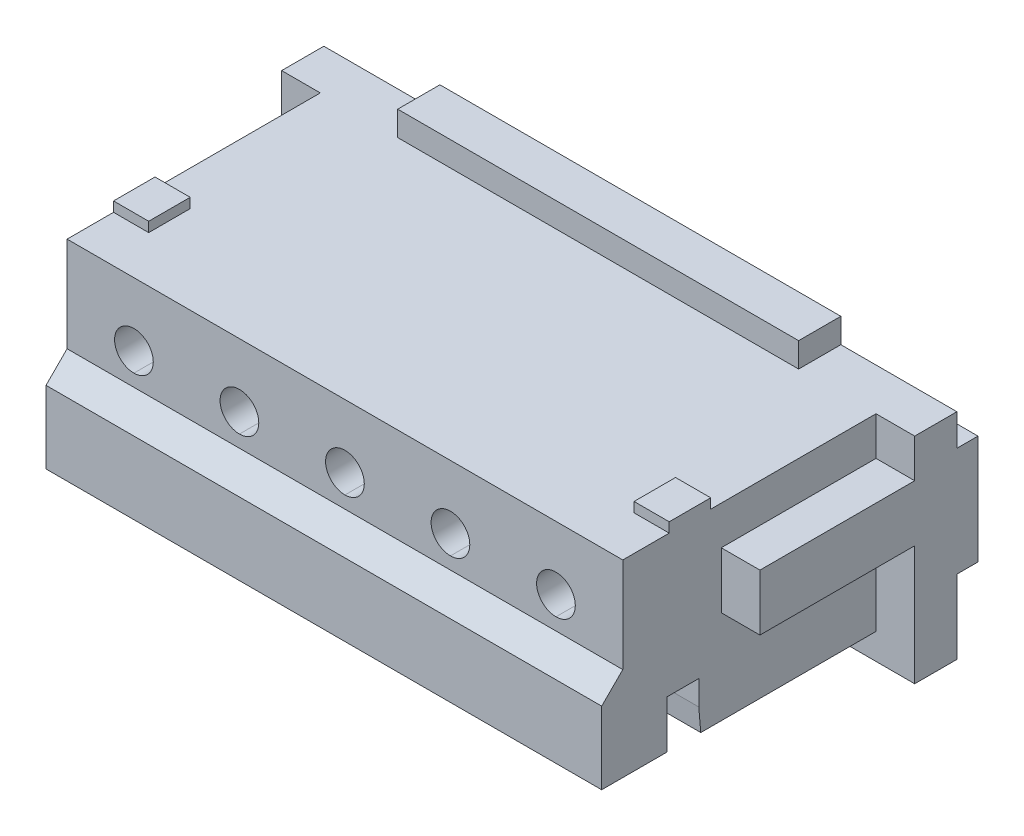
ISO-10303-21;
HEADER;
FILE_DESCRIPTION(('STEP AP214'),'2;1');
FILE_NAME('part.step','',(''),(''),'','','');
FILE_SCHEMA(('AUTOMOTIVE_DESIGN { 1 0 10303 214 1 1 1 1 }'));
ENDSEC;
DATA;
#1=APPLICATION_CONTEXT('core data for automotive mechanical design processes');
#2=APPLICATION_PROTOCOL_DEFINITION('international standard','automotive_design',2000,#1);
#3=PRODUCT_CONTEXT('',#1,'mechanical');
#4=PRODUCT('Part','Part','',(#3));
#5=PRODUCT_RELATED_PRODUCT_CATEGORY('part','',(#4));
#6=PRODUCT_DEFINITION_FORMATION('','',#4);
#7=PRODUCT_DEFINITION_CONTEXT('part definition',#1,'design');
#8=PRODUCT_DEFINITION('design','',#6,#7);
#9=PRODUCT_DEFINITION_SHAPE('','',#8);
#10=(LENGTH_UNIT() NAMED_UNIT(*) SI_UNIT(.MILLI.,.METRE.));
#11=(NAMED_UNIT(*) PLANE_ANGLE_UNIT() SI_UNIT($,.RADIAN.));
#12=(NAMED_UNIT(*) SI_UNIT($,.STERADIAN.) SOLID_ANGLE_UNIT());
#13=UNCERTAINTY_MEASURE_WITH_UNIT(LENGTH_MEASURE(1.E-05),#10,'distance_accuracy_value','');
#14=(GEOMETRIC_REPRESENTATION_CONTEXT(3) GLOBAL_UNCERTAINTY_ASSIGNED_CONTEXT((#13)) GLOBAL_UNIT_ASSIGNED_CONTEXT((#10,
#11,#12)) REPRESENTATION_CONTEXT('',''));
#15=CARTESIAN_POINT('',(0.,0.,0.));
#16=DIRECTION('',(0.,0.,1.));
#17=DIRECTION('',(1.,0.,0.));
#18=AXIS2_PLACEMENT_3D('',#15,#16,#17);
#19=CARTESIAN_POINT('',(0.560000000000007,-1.09999999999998,-3.9));
#20=DIRECTION('',(0.,0.,-1.));
#21=DIRECTION('',(-1.,0.,0.));
#22=AXIS2_PLACEMENT_3D('',#19,#20,#21);
#23=PLANE('',#22);
#24=DIRECTION('',(0.,-1.,0.));
#25=VECTOR('',#24,1.);
#26=CARTESIAN_POINT('',(0.56,0.450000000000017,-3.9));
#27=LINE('',#26,#25);
#28=CARTESIAN_POINT('',(0.56,0.450000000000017,-3.9));
#29=VERTEX_POINT('',#28);
#30=CARTESIAN_POINT('',(0.560000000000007,-1.09999999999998,-3.9));
#31=VERTEX_POINT('',#30);
#32=EDGE_CURVE('E10',#29,#31,#27,.T.);
#33=ORIENTED_EDGE('',*,*,#32,.T.);
#34=DIRECTION('',(-1.,0.,0.));
#35=VECTOR('',#34,1.);
#36=CARTESIAN_POINT('',(0.560000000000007,-1.09999999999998,-3.9));
#37=LINE('',#36,#35);
#38=CARTESIAN_POINT('',(-0.559999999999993,-1.1,-3.9));
#39=VERTEX_POINT('',#38);
#40=EDGE_CURVE('E1524',#31,#39,#37,.T.);
#41=ORIENTED_EDGE('',*,*,#40,.T.);
#42=DIRECTION('',(0.,1.,0.));
#43=VECTOR('',#42,1.);
#44=CARTESIAN_POINT('',(-0.56,0.45000000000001,-3.9));
#45=LINE('',#44,#43);
#46=CARTESIAN_POINT('',(-0.56,0.45000000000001,-3.9));
#47=VERTEX_POINT('',#46);
#48=EDGE_CURVE('E47',#39,#47,#45,.T.);
#49=ORIENTED_EDGE('',*,*,#48,.T.);
#50=DIRECTION('',(1.,0.,0.));
#51=VECTOR('',#50,1.);
#52=CARTESIAN_POINT('',(0.56,0.450000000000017,-3.9));
#53=LINE('',#52,#51);
#54=EDGE_CURVE('E1416',#47,#29,#53,.T.);
#55=ORIENTED_EDGE('',*,*,#54,.T.);
#56=EDGE_LOOP('',(#33,#41,#49,#55));
#57=FACE_BOUND('',#56,.T.);
#58=ADVANCED_FACE('F16',(#57),#23,.T.);
#59=CARTESIAN_POINT('',(-0.94,-1.1,-3.9));
#60=DIRECTION('',(0.,0.,-1.));
#61=DIRECTION('',(-1.,0.,0.));
#62=AXIS2_PLACEMENT_3D('',#59,#60,#61);
#63=PLANE('',#62);
#64=DIRECTION('',(0.,-1.,0.));
#65=VECTOR('',#64,1.);
#66=CARTESIAN_POINT('',(-0.94,0.450000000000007,-3.9));
#67=LINE('',#66,#65);
#68=CARTESIAN_POINT('',(-0.94,0.450000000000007,-3.9));
#69=VERTEX_POINT('',#68);
#70=CARTESIAN_POINT('',(-0.94,-1.1,-3.9));
#71=VERTEX_POINT('',#70);
#72=EDGE_CURVE('E1553',#69,#71,#67,.T.);
#73=ORIENTED_EDGE('',*,*,#72,.T.);
#74=DIRECTION('',(-1.,0.,0.));
#75=VECTOR('',#74,1.);
#76=CARTESIAN_POINT('',(-0.94,-1.1,-3.9));
#77=LINE('',#76,#75);
#78=CARTESIAN_POINT('',(-2.06,-1.1,-3.9));
#79=VERTEX_POINT('',#78);
#80=EDGE_CURVE('E1497',#71,#79,#77,.T.);
#81=ORIENTED_EDGE('',*,*,#80,.T.);
#82=DIRECTION('',(0.,1.,0.));
#83=VECTOR('',#82,1.);
#84=CARTESIAN_POINT('',(-2.06,0.45,-3.9));
#85=LINE('',#84,#83);
#86=CARTESIAN_POINT('',(-2.06,0.45,-3.9));
#87=VERTEX_POINT('',#86);
#88=EDGE_CURVE('E1542',#79,#87,#85,.T.);
#89=ORIENTED_EDGE('',*,*,#88,.T.);
#90=DIRECTION('',(1.,0.,0.));
#91=VECTOR('',#90,1.);
#92=CARTESIAN_POINT('',(-0.94,0.450000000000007,-3.9));
#93=LINE('',#92,#91);
#94=EDGE_CURVE('E1406',#87,#69,#93,.T.);
#95=ORIENTED_EDGE('',*,*,#94,.T.);
#96=EDGE_LOOP('',(#73,#81,#89,#95));
#97=FACE_BOUND('',#96,.T.);
#98=ADVANCED_FACE('F1764',(#97),#63,.T.);
#99=CARTESIAN_POINT('',(3.56,-1.09999999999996,-3.9));
#100=DIRECTION('',(0.,0.,-1.));
#101=DIRECTION('',(-1.,0.,0.));
#102=AXIS2_PLACEMENT_3D('',#99,#100,#101);
#103=PLANE('',#102);
#104=DIRECTION('',(0.,-1.,0.));
#105=VECTOR('',#104,1.);
#106=CARTESIAN_POINT('',(3.56,0.450000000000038,-3.9));
#107=LINE('',#106,#105);
#108=CARTESIAN_POINT('',(3.56,0.450000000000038,-3.9));
#109=VERTEX_POINT('',#108);
#110=CARTESIAN_POINT('',(3.56,-1.09999999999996,-3.9));
#111=VERTEX_POINT('',#110);
#112=EDGE_CURVE('E1530',#109,#111,#107,.T.);
#113=ORIENTED_EDGE('',*,*,#112,.T.);
#114=DIRECTION('',(-1.,0.,0.));
#115=VECTOR('',#114,1.);
#116=CARTESIAN_POINT('',(3.56,-1.09999999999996,-3.9));
#117=LINE('',#116,#115);
#118=CARTESIAN_POINT('',(2.44,-1.09999999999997,-3.9));
#119=VERTEX_POINT('',#118);
#120=EDGE_CURVE('E1432',#111,#119,#117,.T.);
#121=ORIENTED_EDGE('',*,*,#120,.T.);
#122=DIRECTION('',(0.,1.,0.));
#123=VECTOR('',#122,1.);
#124=CARTESIAN_POINT('',(2.44,0.45000000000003,-3.9));
#125=LINE('',#124,#123);
#126=CARTESIAN_POINT('',(2.44,0.45000000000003,-3.9));
#127=VERTEX_POINT('',#126);
#128=EDGE_CURVE('E1566',#119,#127,#125,.T.);
#129=ORIENTED_EDGE('',*,*,#128,.T.);
#130=DIRECTION('',(1.,0.,0.));
#131=VECTOR('',#130,1.);
#132=CARTESIAN_POINT('',(3.56,0.450000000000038,-3.9));
#133=LINE('',#132,#131);
#134=EDGE_CURVE('E982',#127,#109,#133,.T.);
#135=ORIENTED_EDGE('',*,*,#134,.T.);
#136=EDGE_LOOP('',(#113,#121,#129,#135));
#137=FACE_BOUND('',#136,.T.);
#138=ADVANCED_FACE('F1762',(#137),#103,.T.);
#139=CARTESIAN_POINT('',(-4.5,-1.10000000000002,-4.5));
#140=DIRECTION('',(0.,0.,1.));
#141=DIRECTION('',(0.,-1.,0.));
#142=AXIS2_PLACEMENT_3D('',#139,#140,#141);
#143=PLANE('',#142);
#144=DIRECTION('',(1.,0.,0.));
#145=VECTOR('',#144,1.);
#146=CARTESIAN_POINT('',(-4.5,-1.10000000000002,-4.5));
#147=LINE('',#146,#145);
#148=CARTESIAN_POINT('',(0.560000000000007,-1.09999999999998,-4.5));
#149=VERTEX_POINT('',#148);
#150=CARTESIAN_POINT('',(0.94,-1.09999999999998,-4.5));
#151=VERTEX_POINT('',#150);
#152=EDGE_CURVE('E1485',#149,#151,#147,.T.);
#153=ORIENTED_EDGE('',*,*,#152,.F.);
#154=DIRECTION('',(0.,-1.,0.));
#155=VECTOR('',#154,1.);
#156=CARTESIAN_POINT('',(0.56,0.450000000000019,-4.5));
#157=LINE('',#156,#155);
#158=CARTESIAN_POINT('',(0.56,0.450000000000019,-4.5));
#159=VERTEX_POINT('',#158);
#160=EDGE_CURVE('E25',#159,#149,#157,.T.);
#161=ORIENTED_EDGE('',*,*,#160,.F.);
#162=DIRECTION('',(1.,0.,0.));
#163=VECTOR('',#162,1.);
#164=CARTESIAN_POINT('',(-4.5,0.449999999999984,-4.5));
#165=LINE('',#164,#163);
#166=CARTESIAN_POINT('',(0.94,0.450000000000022,-4.5));
#167=VERTEX_POINT('',#166);
#168=EDGE_CURVE('E1386',#159,#167,#165,.T.);
#169=ORIENTED_EDGE('',*,*,#168,.T.);
#170=DIRECTION('',(0.,1.,0.));
#171=VECTOR('',#170,1.);
#172=CARTESIAN_POINT('',(0.94,0.450000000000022,-4.5));
#173=LINE('',#172,#171);
#174=EDGE_CURVE('E1505',#151,#167,#173,.T.);
#175=ORIENTED_EDGE('',*,*,#174,.F.);
#176=EDGE_LOOP('',(#153,#161,#169,#175));
#177=FACE_BOUND('',#176,.T.);
#178=ADVANCED_FACE('F18',(#177),#143,.F.);
#179=CARTESIAN_POINT('',(0.56,0.450000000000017,-3.9));
#180=DIRECTION('',(1.,0.,0.));
#181=DIRECTION('',(0.,1.,0.));
#182=AXIS2_PLACEMENT_3D('',#179,#180,#181);
#183=PLANE('',#182);
#184=ORIENTED_EDGE('',*,*,#160,.T.);
#185=DIRECTION('',(0.,0.,-1.));
#186=VECTOR('',#185,1.);
#187=CARTESIAN_POINT('',(0.560000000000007,-1.09999999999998,-3.9));
#188=LINE('',#187,#186);
#189=CARTESIAN_POINT('',(0.560000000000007,-1.09999999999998,-4.2));
#190=VERTEX_POINT('',#189);
#191=EDGE_CURVE('E1481',#190,#149,#188,.T.);
#192=ORIENTED_EDGE('',*,*,#191,.F.);
#193=DIRECTION('',(0.,0.,-1.));
#194=VECTOR('',#193,1.);
#195=CARTESIAN_POINT('',(0.560000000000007,-1.09999999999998,-3.9));
#196=LINE('',#195,#194);
#197=EDGE_CURVE('E1527',#31,#190,#196,.T.);
#198=ORIENTED_EDGE('',*,*,#197,.F.);
#199=ORIENTED_EDGE('',*,*,#32,.F.);
#200=DIRECTION('',(0.,0.,-1.));
#201=VECTOR('',#200,1.);
#202=CARTESIAN_POINT('',(0.56,0.450000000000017,-3.9));
#203=LINE('',#202,#201);
#204=CARTESIAN_POINT('',(0.56,0.450000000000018,-4.2));
#205=VERTEX_POINT('',#204);
#206=EDGE_CURVE('E1413',#29,#205,#203,.T.);
#207=ORIENTED_EDGE('',*,*,#206,.T.);
#208=DIRECTION('',(0.,0.,-1.));
#209=VECTOR('',#208,1.);
#210=CARTESIAN_POINT('',(0.56,0.450000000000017,-3.9));
#211=LINE('',#210,#209);
#212=EDGE_CURVE('E1390',#205,#159,#211,.T.);
#213=ORIENTED_EDGE('',*,*,#212,.T.);
#214=EDGE_LOOP('',(#184,#192,#198,#199,#207,#213));
#215=FACE_BOUND('',#214,.T.);
#216=ADVANCED_FACE('F1574',(#215),#183,.F.);
#217=CARTESIAN_POINT('',(2.44,0.45000000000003,-3.9));
#218=DIRECTION('',(-1.,0.,0.));
#219=DIRECTION('',(0.,1.,0.));
#220=AXIS2_PLACEMENT_3D('',#217,#218,#219);
#221=PLANE('',#220);
#222=DIRECTION('',(0.,1.,0.));
#223=VECTOR('',#222,1.);
#224=CARTESIAN_POINT('',(2.44,0.450000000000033,-4.5));
#225=LINE('',#224,#223);
#226=CARTESIAN_POINT('',(2.44,-1.09999999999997,-4.5));
#227=VERTEX_POINT('',#226);
#228=CARTESIAN_POINT('',(2.44,0.450000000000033,-4.5));
#229=VERTEX_POINT('',#228);
#230=EDGE_CURVE('E1563',#227,#229,#225,.T.);
#231=ORIENTED_EDGE('',*,*,#230,.T.);
#232=DIRECTION('',(0.,0.,-1.));
#233=VECTOR('',#232,1.);
#234=CARTESIAN_POINT('',(2.44,0.45000000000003,-3.9));
#235=LINE('',#234,#233);
#236=CARTESIAN_POINT('',(2.44,0.450000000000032,-4.2));
#237=VERTEX_POINT('',#236);
#238=EDGE_CURVE('E1382',#237,#229,#235,.T.);
#239=ORIENTED_EDGE('',*,*,#238,.F.);
#240=DIRECTION('',(0.,0.,-1.));
#241=VECTOR('',#240,1.);
#242=CARTESIAN_POINT('',(2.44,0.45000000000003,-3.9));
#243=LINE('',#242,#241);
#244=EDGE_CURVE('E1400',#127,#237,#243,.T.);
#245=ORIENTED_EDGE('',*,*,#244,.F.);
#246=ORIENTED_EDGE('',*,*,#128,.F.);
#247=DIRECTION('',(0.,0.,-1.));
#248=VECTOR('',#247,1.);
#249=CARTESIAN_POINT('',(2.44,-1.09999999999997,-3.9));
#250=LINE('',#249,#248);
#251=CARTESIAN_POINT('',(2.44,-1.09999999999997,-4.2));
#252=VERTEX_POINT('',#251);
#253=EDGE_CURVE('E1428',#119,#252,#250,.T.);
#254=ORIENTED_EDGE('',*,*,#253,.T.);
#255=DIRECTION('',(0.,0.,-1.));
#256=VECTOR('',#255,1.);
#257=CARTESIAN_POINT('',(2.44,-1.09999999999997,-3.9));
#258=LINE('',#257,#256);
#259=EDGE_CURVE('E1466',#252,#227,#258,.T.);
#260=ORIENTED_EDGE('',*,*,#259,.T.);
#261=EDGE_LOOP('',(#231,#239,#245,#246,#254,#260));
#262=FACE_BOUND('',#261,.T.);
#263=ADVANCED_FACE('F1626',(#262),#221,.F.);
#264=CARTESIAN_POINT('',(-4.5,-1.10000000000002,-4.5));
#265=DIRECTION('',(0.,0.,1.));
#266=DIRECTION('',(0.,-1.,0.));
#267=AXIS2_PLACEMENT_3D('',#264,#265,#266);
#268=PLANE('',#267);
#269=DIRECTION('',(1.,0.,0.));
#270=VECTOR('',#269,1.);
#271=CARTESIAN_POINT('',(-4.5,-1.10000000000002,-4.5));
#272=LINE('',#271,#270);
#273=CARTESIAN_POINT('',(2.06,-1.09999999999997,-4.5));
#274=VERTEX_POINT('',#273);
#275=EDGE_CURVE('E1462',#274,#227,#272,.T.);
#276=ORIENTED_EDGE('',*,*,#275,.F.);
#277=DIRECTION('',(0.,-1.,0.));
#278=VECTOR('',#277,1.);
#279=CARTESIAN_POINT('',(2.06,0.45000000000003,-4.5));
#280=LINE('',#279,#278);
#281=CARTESIAN_POINT('',(2.06,0.45000000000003,-4.5));
#282=VERTEX_POINT('',#281);
#283=EDGE_CURVE('E1508',#282,#274,#280,.T.);
#284=ORIENTED_EDGE('',*,*,#283,.F.);
#285=DIRECTION('',(1.,0.,0.));
#286=VECTOR('',#285,1.);
#287=CARTESIAN_POINT('',(-4.5,0.449999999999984,-4.5));
#288=LINE('',#287,#286);
#289=EDGE_CURVE('E1288',#282,#229,#288,.T.);
#290=ORIENTED_EDGE('',*,*,#289,.T.);
#291=ORIENTED_EDGE('',*,*,#230,.F.);
#292=EDGE_LOOP('',(#276,#284,#290,#291));
#293=FACE_BOUND('',#292,.T.);
#294=ADVANCED_FACE('F1760',(#293),#268,.F.);
#295=CARTESIAN_POINT('',(2.06,0.450000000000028,-3.9));
#296=DIRECTION('',(1.,0.,0.));
#297=DIRECTION('',(0.,1.,0.));
#298=AXIS2_PLACEMENT_3D('',#295,#296,#297);
#299=PLANE('',#298);
#300=ORIENTED_EDGE('',*,*,#283,.T.);
#301=DIRECTION('',(0.,0.,-1.));
#302=VECTOR('',#301,1.);
#303=CARTESIAN_POINT('',(2.06,-1.09999999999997,-3.9));
#304=LINE('',#303,#302);
#305=CARTESIAN_POINT('',(2.06,-1.09999999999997,-4.2));
#306=VERTEX_POINT('',#305);
#307=EDGE_CURVE('E1458',#306,#274,#304,.T.);
#308=ORIENTED_EDGE('',*,*,#307,.F.);
#309=DIRECTION('',(0.,0.,-1.));
#310=VECTOR('',#309,1.);
#311=CARTESIAN_POINT('',(2.06,-1.09999999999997,-3.9));
#312=LINE('',#311,#310);
#313=CARTESIAN_POINT('',(2.06,-1.09999999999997,-3.9));
#314=VERTEX_POINT('',#313);
#315=EDGE_CURVE('E1478',#314,#306,#312,.T.);
#316=ORIENTED_EDGE('',*,*,#315,.F.);
#317=DIRECTION('',(0.,-1.,0.));
#318=VECTOR('',#317,1.);
#319=CARTESIAN_POINT('',(2.06,0.450000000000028,-3.9));
#320=LINE('',#319,#318);
#321=CARTESIAN_POINT('',(2.06,0.450000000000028,-3.9));
#322=VERTEX_POINT('',#321);
#323=EDGE_CURVE('E1556',#322,#314,#320,.T.);
#324=ORIENTED_EDGE('',*,*,#323,.F.);
#325=DIRECTION('',(0.,0.,-1.));
#326=VECTOR('',#325,1.);
#327=CARTESIAN_POINT('',(2.06,0.450000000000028,-3.9));
#328=LINE('',#327,#326);
#329=CARTESIAN_POINT('',(2.06,0.450000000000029,-4.2));
#330=VERTEX_POINT('',#329);
#331=EDGE_CURVE('E1368',#322,#330,#328,.T.);
#332=ORIENTED_EDGE('',*,*,#331,.T.);
#333=DIRECTION('',(0.,0.,-1.));
#334=VECTOR('',#333,1.);
#335=CARTESIAN_POINT('',(2.06,0.450000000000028,-3.9));
#336=LINE('',#335,#334);
#337=EDGE_CURVE('E1378',#330,#282,#336,.T.);
#338=ORIENTED_EDGE('',*,*,#337,.T.);
#339=EDGE_LOOP('',(#300,#308,#316,#324,#332,#338));
#340=FACE_BOUND('',#339,.T.);
#341=ADVANCED_FACE('F1758',(#340),#299,.F.);
#342=CARTESIAN_POINT('',(0.94,0.45000000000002,-3.9));
#343=DIRECTION('',(-1.,0.,0.));
#344=DIRECTION('',(0.,1.,0.));
#345=AXIS2_PLACEMENT_3D('',#342,#343,#344);
#346=PLANE('',#345);
#347=ORIENTED_EDGE('',*,*,#174,.T.);
#348=DIRECTION('',(0.,0.,-1.));
#349=VECTOR('',#348,1.);
#350=CARTESIAN_POINT('',(0.94,0.45000000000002,-3.9));
#351=LINE('',#350,#349);
#352=CARTESIAN_POINT('',(0.94,0.450000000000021,-4.2));
#353=VERTEX_POINT('',#352);
#354=EDGE_CURVE('E983',#353,#167,#351,.T.);
#355=ORIENTED_EDGE('',*,*,#354,.F.);
#356=DIRECTION('',(0.,0.,-1.));
#357=VECTOR('',#356,1.);
#358=CARTESIAN_POINT('',(0.94,0.45000000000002,-3.9));
#359=LINE('',#358,#357);
#360=CARTESIAN_POINT('',(0.94,0.45000000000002,-3.9));
#361=VERTEX_POINT('',#360);
#362=EDGE_CURVE('E1284',#361,#353,#359,.T.);
#363=ORIENTED_EDGE('',*,*,#362,.F.);
#364=DIRECTION('',(0.,1.,0.));
#365=VECTOR('',#364,1.);
#366=CARTESIAN_POINT('',(0.94,0.45000000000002,-3.9));
#367=LINE('',#366,#365);
#368=CARTESIAN_POINT('',(0.94,-1.09999999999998,-3.9));
#369=VERTEX_POINT('',#368);
#370=EDGE_CURVE('E1509',#369,#361,#367,.T.);
#371=ORIENTED_EDGE('',*,*,#370,.F.);
#372=DIRECTION('',(0.,0.,-1.));
#373=VECTOR('',#372,1.);
#374=CARTESIAN_POINT('',(0.94,-1.09999999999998,-3.9));
#375=LINE('',#374,#373);
#376=CARTESIAN_POINT('',(0.94,-1.09999999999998,-4.2));
#377=VERTEX_POINT('',#376);
#378=EDGE_CURVE('E1470',#369,#377,#375,.T.);
#379=ORIENTED_EDGE('',*,*,#378,.T.);
#380=DIRECTION('',(0.,0.,-1.));
#381=VECTOR('',#380,1.);
#382=CARTESIAN_POINT('',(0.94,-1.09999999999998,-3.9));
#383=LINE('',#382,#381);
#384=EDGE_CURVE('E1489',#377,#151,#383,.T.);
#385=ORIENTED_EDGE('',*,*,#384,.T.);
#386=EDGE_LOOP('',(#347,#355,#363,#371,#379,#385));
#387=FACE_BOUND('',#386,.T.);
#388=ADVANCED_FACE('F1605',(#387),#346,.F.);
#389=CARTESIAN_POINT('',(2.06,-1.09999999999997,-3.9));
#390=DIRECTION('',(0.,0.,-1.));
#391=DIRECTION('',(-1.,0.,0.));
#392=AXIS2_PLACEMENT_3D('',#389,#390,#391);
#393=PLANE('',#392);
#394=ORIENTED_EDGE('',*,*,#323,.T.);
#395=DIRECTION('',(-1.,0.,0.));
#396=VECTOR('',#395,1.);
#397=CARTESIAN_POINT('',(2.06,-1.09999999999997,-3.9));
#398=LINE('',#397,#396);
#399=EDGE_CURVE('E1474',#314,#369,#398,.T.);
#400=ORIENTED_EDGE('',*,*,#399,.T.);
#401=ORIENTED_EDGE('',*,*,#370,.T.);
#402=DIRECTION('',(1.,0.,0.));
#403=VECTOR('',#402,1.);
#404=CARTESIAN_POINT('',(2.06,0.450000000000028,-3.9));
#405=LINE('',#404,#403);
#406=EDGE_CURVE('E1289',#361,#322,#405,.T.);
#407=ORIENTED_EDGE('',*,*,#406,.T.);
#408=EDGE_LOOP('',(#394,#400,#401,#407));
#409=FACE_BOUND('',#408,.T.);
#410=ADVANCED_FACE('F1611',(#409),#393,.T.);
#411=CARTESIAN_POINT('',(-2.44,-1.1,-3.9));
#412=DIRECTION('',(0.,0.,-1.));
#413=DIRECTION('',(-1.,0.,0.));
#414=AXIS2_PLACEMENT_3D('',#411,#412,#413);
#415=PLANE('',#414);
#416=DIRECTION('',(0.,-1.,0.));
#417=VECTOR('',#416,1.);
#418=CARTESIAN_POINT('',(-2.44,0.45,-3.9));
#419=LINE('',#418,#417);
#420=CARTESIAN_POINT('',(-2.44,0.45,-3.9));
#421=VERTEX_POINT('',#420);
#422=CARTESIAN_POINT('',(-2.44,-1.1,-3.9));
#423=VERTEX_POINT('',#422);
#424=EDGE_CURVE('E1539',#421,#423,#419,.T.);
#425=ORIENTED_EDGE('',*,*,#424,.T.);
#426=DIRECTION('',(-1.,0.,0.));
#427=VECTOR('',#426,1.);
#428=CARTESIAN_POINT('',(-2.44,-1.1,-3.9));
#429=LINE('',#428,#427);
#430=CARTESIAN_POINT('',(-3.56,-1.10000000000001,-3.9));
#431=VERTEX_POINT('',#430);
#432=EDGE_CURVE('E1451',#423,#431,#429,.T.);
#433=ORIENTED_EDGE('',*,*,#432,.T.);
#434=DIRECTION('',(0.,1.,0.));
#435=VECTOR('',#434,1.);
#436=CARTESIAN_POINT('',(-3.56,0.449999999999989,-3.9));
#437=LINE('',#436,#435);
#438=CARTESIAN_POINT('',(-3.56,0.449999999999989,-3.9));
#439=VERTEX_POINT('',#438);
#440=EDGE_CURVE('E1422',#431,#439,#437,.T.);
#441=ORIENTED_EDGE('',*,*,#440,.T.);
#442=DIRECTION('',(1.,0.,0.));
#443=VECTOR('',#442,1.);
#444=CARTESIAN_POINT('',(-2.44,0.45,-3.9));
#445=LINE('',#444,#443);
#446=EDGE_CURVE('E1361',#439,#421,#445,.T.);
#447=ORIENTED_EDGE('',*,*,#446,.T.);
#448=EDGE_LOOP('',(#425,#433,#441,#447));
#449=FACE_BOUND('',#448,.T.);
#450=ADVANCED_FACE('F1864',(#449),#415,.T.);
#451=CARTESIAN_POINT('',(-0.94,0.450000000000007,-3.9));
#452=DIRECTION('',(1.,0.,0.));
#453=DIRECTION('',(0.,1.,0.));
#454=AXIS2_PLACEMENT_3D('',#451,#452,#453);
#455=PLANE('',#454);
#456=DIRECTION('',(0.,-1.,0.));
#457=VECTOR('',#456,1.);
#458=CARTESIAN_POINT('',(-0.94,0.450000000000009,-4.5));
#459=LINE('',#458,#457);
#460=CARTESIAN_POINT('',(-0.94,0.450000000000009,-4.5));
#461=VERTEX_POINT('',#460);
#462=CARTESIAN_POINT('',(-0.94,-1.1,-4.5));
#463=VERTEX_POINT('',#462);
#464=EDGE_CURVE('E1550',#461,#463,#459,.T.);
#465=ORIENTED_EDGE('',*,*,#464,.T.);
#466=DIRECTION('',(0.,0.,-1.));
#467=VECTOR('',#466,1.);
#468=CARTESIAN_POINT('',(-0.94,-1.1,-3.9));
#469=LINE('',#468,#467);
#470=CARTESIAN_POINT('',(-0.94,-1.1,-4.2));
#471=VERTEX_POINT('',#470);
#472=EDGE_CURVE('E1439',#471,#463,#469,.T.);
#473=ORIENTED_EDGE('',*,*,#472,.F.);
#474=DIRECTION('',(0.,0.,-1.));
#475=VECTOR('',#474,1.);
#476=CARTESIAN_POINT('',(-0.94,-1.1,-3.9));
#477=LINE('',#476,#475);
#478=EDGE_CURVE('E1501',#71,#471,#477,.T.);
#479=ORIENTED_EDGE('',*,*,#478,.F.);
#480=ORIENTED_EDGE('',*,*,#72,.F.);
#481=DIRECTION('',(0.,0.,-1.));
#482=VECTOR('',#481,1.);
#483=CARTESIAN_POINT('',(-0.94,0.450000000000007,-3.9));
#484=LINE('',#483,#482);
#485=CARTESIAN_POINT('',(-0.94,0.450000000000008,-4.2));
#486=VERTEX_POINT('',#485);
#487=EDGE_CURVE('E1403',#69,#486,#484,.T.);
#488=ORIENTED_EDGE('',*,*,#487,.T.);
#489=DIRECTION('',(0.,0.,-1.));
#490=VECTOR('',#489,1.);
#491=CARTESIAN_POINT('',(-0.94,0.450000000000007,-3.9));
#492=LINE('',#491,#490);
#493=EDGE_CURVE('E1350',#486,#461,#492,.T.);
#494=ORIENTED_EDGE('',*,*,#493,.T.);
#495=EDGE_LOOP('',(#465,#473,#479,#480,#488,#494));
#496=FACE_BOUND('',#495,.T.);
#497=ADVANCED_FACE('F1683',(#496),#455,.F.);
#498=CARTESIAN_POINT('',(-4.5,-1.10000000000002,-4.5));
#499=DIRECTION('',(0.,0.,1.));
#500=DIRECTION('',(0.,-1.,0.));
#501=AXIS2_PLACEMENT_3D('',#498,#499,#500);
#502=PLANE('',#501);
#503=DIRECTION('',(1.,0.,0.));
#504=VECTOR('',#503,1.);
#505=CARTESIAN_POINT('',(-4.5,-1.10000000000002,-4.5));
#506=LINE('',#505,#504);
#507=CARTESIAN_POINT('',(-0.559999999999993,-1.09999999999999,-4.5));
#508=VERTEX_POINT('',#507);
#509=EDGE_CURVE('E1443',#463,#508,#506,.T.);
#510=ORIENTED_EDGE('',*,*,#509,.F.);
#511=ORIENTED_EDGE('',*,*,#464,.F.);
#512=DIRECTION('',(1.,0.,0.));
#513=VECTOR('',#512,1.);
#514=CARTESIAN_POINT('',(-4.5,0.449999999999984,-4.5));
#515=LINE('',#514,#513);
#516=CARTESIAN_POINT('',(-0.56,0.450000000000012,-4.5));
#517=VERTEX_POINT('',#516);
#518=EDGE_CURVE('E1346',#461,#517,#515,.T.);
#519=ORIENTED_EDGE('',*,*,#518,.T.);
#520=DIRECTION('',(0.,1.,0.));
#521=VECTOR('',#520,1.);
#522=CARTESIAN_POINT('',(-0.56,0.450000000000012,-4.5));
#523=LINE('',#522,#521);
#524=EDGE_CURVE('E1545',#508,#517,#523,.T.);
#525=ORIENTED_EDGE('',*,*,#524,.F.);
#526=EDGE_LOOP('',(#510,#511,#519,#525));
#527=FACE_BOUND('',#526,.T.);
#528=ADVANCED_FACE('F1694',(#527),#502,.F.);
#529=CARTESIAN_POINT('',(-0.56,0.45000000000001,-3.9));
#530=DIRECTION('',(-1.,0.,0.));
#531=DIRECTION('',(0.,1.,0.));
#532=AXIS2_PLACEMENT_3D('',#529,#530,#531);
#533=PLANE('',#532);
#534=ORIENTED_EDGE('',*,*,#524,.T.);
#535=DIRECTION('',(0.,0.,-1.));
#536=VECTOR('',#535,1.);
#537=CARTESIAN_POINT('',(-0.56,0.45000000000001,-3.9));
#538=LINE('',#537,#536);
#539=CARTESIAN_POINT('',(-0.56,0.450000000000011,-4.2));
#540=VERTEX_POINT('',#539);
#541=EDGE_CURVE('E1354',#540,#517,#538,.T.);
#542=ORIENTED_EDGE('',*,*,#541,.F.);
#543=DIRECTION('',(0.,0.,-1.));
#544=VECTOR('',#543,1.);
#545=CARTESIAN_POINT('',(-0.56,0.45000000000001,-3.9));
#546=LINE('',#545,#544);
#547=EDGE_CURVE('E1419',#47,#540,#546,.T.);
#548=ORIENTED_EDGE('',*,*,#547,.F.);
#549=ORIENTED_EDGE('',*,*,#48,.F.);
#550=DIRECTION('',(0.,0.,-1.));
#551=VECTOR('',#550,1.);
#552=CARTESIAN_POINT('',(-0.559999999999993,-1.1,-3.9));
#553=LINE('',#552,#551);
#554=CARTESIAN_POINT('',(-0.559999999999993,-1.1,-4.2));
#555=VERTEX_POINT('',#554);
#556=EDGE_CURVE('E1521',#39,#555,#553,.T.);
#557=ORIENTED_EDGE('',*,*,#556,.T.);
#558=DIRECTION('',(0.,0.,-1.));
#559=VECTOR('',#558,1.);
#560=CARTESIAN_POINT('',(-0.559999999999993,-1.1,-3.9));
#561=LINE('',#560,#559);
#562=EDGE_CURVE('E1447',#555,#508,#561,.T.);
#563=ORIENTED_EDGE('',*,*,#562,.T.);
#564=EDGE_LOOP('',(#534,#542,#548,#549,#557,#563));
#565=FACE_BOUND('',#564,.T.);
#566=ADVANCED_FACE('F1688',(#565),#533,.F.);
#567=CARTESIAN_POINT('',(-2.06,0.45,-3.9));
#568=DIRECTION('',(-1.,0.,0.));
#569=DIRECTION('',(0.,1.,0.));
#570=AXIS2_PLACEMENT_3D('',#567,#568,#569);
#571=PLANE('',#570);
#572=DIRECTION('',(0.,1.,0.));
#573=VECTOR('',#572,1.);
#574=CARTESIAN_POINT('',(-2.06,0.45,-4.5));
#575=LINE('',#574,#573);
#576=CARTESIAN_POINT('',(-2.06,-1.1,-4.5));
#577=VERTEX_POINT('',#576);
#578=CARTESIAN_POINT('',(-2.06,0.45,-4.5));
#579=VERTEX_POINT('',#578);
#580=EDGE_CURVE('E1536',#577,#579,#575,.T.);
#581=ORIENTED_EDGE('',*,*,#580,.T.);
#582=DIRECTION('',(0.,0.,-1.));
#583=VECTOR('',#582,1.);
#584=CARTESIAN_POINT('',(-2.06,0.45,-3.9));
#585=LINE('',#584,#583);
#586=CARTESIAN_POINT('',(-2.06,0.45,-4.2));
#587=VERTEX_POINT('',#586);
#588=EDGE_CURVE('E1276',#587,#579,#585,.T.);
#589=ORIENTED_EDGE('',*,*,#588,.F.);
#590=DIRECTION('',(0.,0.,-1.));
#591=VECTOR('',#590,1.);
#592=CARTESIAN_POINT('',(-2.06,0.45,-3.9));
#593=LINE('',#592,#591);
#594=EDGE_CURVE('E1410',#87,#587,#593,.T.);
#595=ORIENTED_EDGE('',*,*,#594,.F.);
#596=ORIENTED_EDGE('',*,*,#88,.F.);
#597=DIRECTION('',(0.,0.,-1.));
#598=VECTOR('',#597,1.);
#599=CARTESIAN_POINT('',(-2.06,-1.1,-3.9));
#600=LINE('',#599,#598);
#601=CARTESIAN_POINT('',(-2.06,-1.1,-4.2));
#602=VERTEX_POINT('',#601);
#603=EDGE_CURVE('E1493',#79,#602,#600,.T.);
#604=ORIENTED_EDGE('',*,*,#603,.T.);
#605=DIRECTION('',(0.,0.,-1.));
#606=VECTOR('',#605,1.);
#607=CARTESIAN_POINT('',(-2.06,-1.1,-3.9));
#608=LINE('',#607,#606);
#609=EDGE_CURVE('E1517',#602,#577,#608,.T.);
#610=ORIENTED_EDGE('',*,*,#609,.T.);
#611=EDGE_LOOP('',(#581,#589,#595,#596,#604,#610));
#612=FACE_BOUND('',#611,.T.);
#613=ADVANCED_FACE('F1852',(#612),#571,.F.);
#614=CARTESIAN_POINT('',(-2.44,0.45,-3.9));
#615=DIRECTION('',(1.,0.,0.));
#616=DIRECTION('',(0.,1.,0.));
#617=AXIS2_PLACEMENT_3D('',#614,#615,#616);
#618=PLANE('',#617);
#619=DIRECTION('',(0.,-1.,0.));
#620=VECTOR('',#619,1.);
#621=CARTESIAN_POINT('',(-2.44,0.45,-4.5));
#622=LINE('',#621,#620);
#623=CARTESIAN_POINT('',(-2.44,0.45,-4.5));
#624=VERTEX_POINT('',#623);
#625=CARTESIAN_POINT('',(-2.44,-1.1,-4.5));
#626=VERTEX_POINT('',#625);
#627=EDGE_CURVE('E1533',#624,#626,#622,.T.);
#628=ORIENTED_EDGE('',*,*,#627,.T.);
#629=DIRECTION('',(0.,0.,-1.));
#630=VECTOR('',#629,1.);
#631=CARTESIAN_POINT('',(-2.44,-1.1,-3.9));
#632=LINE('',#631,#630);
#633=CARTESIAN_POINT('',(-2.44,-1.1,-4.2));
#634=VERTEX_POINT('',#633);
#635=EDGE_CURVE('E1504',#634,#626,#632,.T.);
#636=ORIENTED_EDGE('',*,*,#635,.F.);
#637=DIRECTION('',(0.,0.,-1.));
#638=VECTOR('',#637,1.);
#639=CARTESIAN_POINT('',(-2.44,-1.1,-3.9));
#640=LINE('',#639,#638);
#641=EDGE_CURVE('E1454',#423,#634,#640,.T.);
#642=ORIENTED_EDGE('',*,*,#641,.F.);
#643=ORIENTED_EDGE('',*,*,#424,.F.);
#644=DIRECTION('',(0.,0.,-1.));
#645=VECTOR('',#644,1.);
#646=CARTESIAN_POINT('',(-2.44,0.45,-3.9));
#647=LINE('',#646,#645);
#648=CARTESIAN_POINT('',(-2.44,0.45,-4.2));
#649=VERTEX_POINT('',#648);
#650=EDGE_CURVE('E1358',#421,#649,#647,.T.);
#651=ORIENTED_EDGE('',*,*,#650,.T.);
#652=DIRECTION('',(0.,0.,-1.));
#653=VECTOR('',#652,1.);
#654=CARTESIAN_POINT('',(-2.44,0.45,-3.9));
#655=LINE('',#654,#653);
#656=EDGE_CURVE('E1272',#649,#624,#655,.T.);
#657=ORIENTED_EDGE('',*,*,#656,.T.);
#658=EDGE_LOOP('',(#628,#636,#642,#643,#651,#657));
#659=FACE_BOUND('',#658,.T.);
#660=ADVANCED_FACE('F1855',(#659),#618,.F.);
#661=CARTESIAN_POINT('',(-4.5,-1.10000000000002,-4.5));
#662=DIRECTION('',(0.,0.,1.));
#663=DIRECTION('',(0.,-1.,0.));
#664=AXIS2_PLACEMENT_3D('',#661,#662,#663);
#665=PLANE('',#664);
#666=DIRECTION('',(1.,0.,0.));
#667=VECTOR('',#666,1.);
#668=CARTESIAN_POINT('',(-4.5,-1.10000000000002,-4.5));
#669=LINE('',#668,#667);
#670=EDGE_CURVE('E1513',#626,#577,#669,.T.);
#671=ORIENTED_EDGE('',*,*,#670,.F.);
#672=ORIENTED_EDGE('',*,*,#627,.F.);
#673=DIRECTION('',(1.,0.,0.));
#674=VECTOR('',#673,1.);
#675=CARTESIAN_POINT('',(-4.5,0.449999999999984,-4.5));
#676=LINE('',#675,#674);
#677=EDGE_CURVE('E1277',#624,#579,#676,.T.);
#678=ORIENTED_EDGE('',*,*,#677,.T.);
#679=ORIENTED_EDGE('',*,*,#580,.F.);
#680=EDGE_LOOP('',(#671,#672,#678,#679));
#681=FACE_BOUND('',#680,.T.);
#682=ADVANCED_FACE('F1861',(#681),#665,.F.);
#683=CARTESIAN_POINT('',(3.56,0.450000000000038,-3.9));
#684=DIRECTION('',(1.,0.,0.));
#685=DIRECTION('',(0.,1.,0.));
#686=AXIS2_PLACEMENT_3D('',#683,#684,#685);
#687=PLANE('',#686);
#688=DIRECTION('',(0.,-1.,0.));
#689=VECTOR('',#688,1.);
#690=CARTESIAN_POINT('',(3.56,0.450000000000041,-4.5));
#691=LINE('',#690,#689);
#692=CARTESIAN_POINT('',(3.56,0.450000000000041,-4.5));
#693=VERTEX_POINT('',#692);
#694=CARTESIAN_POINT('',(3.56,-1.09999999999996,-4.5));
#695=VERTEX_POINT('',#694);
#696=EDGE_CURVE('E915',#693,#695,#691,.T.);
#697=ORIENTED_EDGE('',*,*,#696,.T.);
#698=DIRECTION('',(0.,0.,-1.));
#699=VECTOR('',#698,1.);
#700=CARTESIAN_POINT('',(3.56,-1.09999999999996,-3.9));
#701=LINE('',#700,#699);
#702=CARTESIAN_POINT('',(3.56,-1.09999999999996,-4.2));
#703=VERTEX_POINT('',#702);
#704=EDGE_CURVE('E919',#703,#695,#701,.T.);
#705=ORIENTED_EDGE('',*,*,#704,.F.);
#706=DIRECTION('',(0.,0.,-1.));
#707=VECTOR('',#706,1.);
#708=CARTESIAN_POINT('',(3.56,-1.09999999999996,-3.9));
#709=LINE('',#708,#707);
#710=EDGE_CURVE('E1436',#111,#703,#709,.T.);
#711=ORIENTED_EDGE('',*,*,#710,.F.);
#712=ORIENTED_EDGE('',*,*,#112,.F.);
#713=DIRECTION('',(0.,0.,-1.));
#714=VECTOR('',#713,1.);
#715=CARTESIAN_POINT('',(3.56,0.450000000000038,-3.9));
#716=LINE('',#715,#714);
#717=CARTESIAN_POINT('',(3.56,0.450000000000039,-4.2));
#718=VERTEX_POINT('',#717);
#719=EDGE_CURVE('E979',#109,#718,#716,.T.);
#720=ORIENTED_EDGE('',*,*,#719,.T.);
#721=DIRECTION('',(0.,0.,-1.));
#722=VECTOR('',#721,1.);
#723=CARTESIAN_POINT('',(3.56,0.450000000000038,-3.9));
#724=LINE('',#723,#722);
#725=EDGE_CURVE('E1332',#718,#693,#724,.T.);
#726=ORIENTED_EDGE('',*,*,#725,.T.);
#727=EDGE_LOOP('',(#697,#705,#711,#712,#720,#726));
#728=FACE_BOUND('',#727,.T.);
#729=ADVANCED_FACE('F1635',(#728),#687,.F.);
#730=CARTESIAN_POINT('',(0.560000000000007,-1.09999999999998,-3.9));
#731=DIRECTION('',(0.,-1.,0.));
#732=DIRECTION('',(0.,0.,-1.));
#733=AXIS2_PLACEMENT_3D('',#730,#731,#732);
#734=PLANE('',#733);
#735=ORIENTED_EDGE('',*,*,#556,.F.);
#736=ORIENTED_EDGE('',*,*,#40,.F.);
#737=ORIENTED_EDGE('',*,*,#197,.T.);
#738=DIRECTION('',(1.,0.,0.));
#739=VECTOR('',#738,1.);
#740=CARTESIAN_POINT('',(-4.5,-1.10000000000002,-4.2));
#741=LINE('',#740,#739);
#742=EDGE_CURVE('E1126',#555,#190,#741,.T.);
#743=ORIENTED_EDGE('',*,*,#742,.F.);
#744=EDGE_LOOP('',(#735,#736,#737,#743));
#745=FACE_BOUND('',#744,.T.);
#746=ADVANCED_FACE('F1587',(#745),#734,.F.);
#747=CARTESIAN_POINT('',(-4.5,-1.10000000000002,-4.2));
#748=DIRECTION('',(0.,1.,0.));
#749=DIRECTION('',(1.,0.,0.));
#750=AXIS2_PLACEMENT_3D('',#747,#748,#749);
#751=PLANE('',#750);
#752=DIRECTION('',(1.,0.,0.));
#753=VECTOR('',#752,1.);
#754=CARTESIAN_POINT('',(-4.5,-1.10000000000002,-4.2));
#755=LINE('',#754,#753);
#756=EDGE_CURVE('E1131',#634,#602,#755,.T.);
#757=ORIENTED_EDGE('',*,*,#756,.F.);
#758=ORIENTED_EDGE('',*,*,#635,.T.);
#759=ORIENTED_EDGE('',*,*,#670,.T.);
#760=ORIENTED_EDGE('',*,*,#609,.F.);
#761=EDGE_LOOP('',(#757,#758,#759,#760));
#762=FACE_BOUND('',#761,.T.);
#763=ADVANCED_FACE('F1674',(#762),#751,.F.);
#764=CARTESIAN_POINT('',(-0.94,-1.1,-3.9));
#765=DIRECTION('',(0.,-1.,0.));
#766=DIRECTION('',(0.,0.,-1.));
#767=AXIS2_PLACEMENT_3D('',#764,#765,#766);
#768=PLANE('',#767);
#769=ORIENTED_EDGE('',*,*,#603,.F.);
#770=ORIENTED_EDGE('',*,*,#80,.F.);
#771=ORIENTED_EDGE('',*,*,#478,.T.);
#772=DIRECTION('',(1.,0.,0.));
#773=VECTOR('',#772,1.);
#774=CARTESIAN_POINT('',(-4.5,-1.10000000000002,-4.2));
#775=LINE('',#774,#773);
#776=EDGE_CURVE('E1127',#602,#471,#775,.T.);
#777=ORIENTED_EDGE('',*,*,#776,.F.);
#778=EDGE_LOOP('',(#769,#770,#771,#777));
#779=FACE_BOUND('',#778,.T.);
#780=ADVANCED_FACE('F1678',(#779),#768,.F.);
#781=CARTESIAN_POINT('',(-4.5,-1.10000000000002,-4.2));
#782=DIRECTION('',(0.,1.,0.));
#783=DIRECTION('',(1.,0.,0.));
#784=AXIS2_PLACEMENT_3D('',#781,#782,#783);
#785=PLANE('',#784);
#786=DIRECTION('',(1.,0.,0.));
#787=VECTOR('',#786,1.);
#788=CARTESIAN_POINT('',(-4.5,-1.10000000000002,-4.2));
#789=LINE('',#788,#787);
#790=EDGE_CURVE('E1312',#190,#377,#789,.T.);
#791=ORIENTED_EDGE('',*,*,#790,.F.);
#792=ORIENTED_EDGE('',*,*,#191,.T.);
#793=ORIENTED_EDGE('',*,*,#152,.T.);
#794=ORIENTED_EDGE('',*,*,#384,.F.);
#795=EDGE_LOOP('',(#791,#792,#793,#794));
#796=FACE_BOUND('',#795,.T.);
#797=ADVANCED_FACE('F1580',(#796),#785,.F.);
#798=CARTESIAN_POINT('',(2.06,-1.09999999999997,-3.9));
#799=DIRECTION('',(0.,-1.,0.));
#800=DIRECTION('',(0.,0.,-1.));
#801=AXIS2_PLACEMENT_3D('',#798,#799,#800);
#802=PLANE('',#801);
#803=ORIENTED_EDGE('',*,*,#378,.F.);
#804=ORIENTED_EDGE('',*,*,#399,.F.);
#805=ORIENTED_EDGE('',*,*,#315,.T.);
#806=DIRECTION('',(1.,0.,0.));
#807=VECTOR('',#806,1.);
#808=CARTESIAN_POINT('',(-4.5,-1.10000000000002,-4.2));
#809=LINE('',#808,#807);
#810=EDGE_CURVE('E1316',#377,#306,#809,.T.);
#811=ORIENTED_EDGE('',*,*,#810,.F.);
#812=EDGE_LOOP('',(#803,#804,#805,#811));
#813=FACE_BOUND('',#812,.T.);
#814=ADVANCED_FACE('F1617',(#813),#802,.F.);
#815=CARTESIAN_POINT('',(-4.5,-1.10000000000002,-4.2));
#816=DIRECTION('',(0.,1.,0.));
#817=DIRECTION('',(1.,0.,0.));
#818=AXIS2_PLACEMENT_3D('',#815,#816,#817);
#819=PLANE('',#818);
#820=DIRECTION('',(1.,0.,0.));
#821=VECTOR('',#820,1.);
#822=CARTESIAN_POINT('',(-4.5,-1.10000000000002,-4.2));
#823=LINE('',#822,#821);
#824=EDGE_CURVE('E1320',#306,#252,#823,.T.);
#825=ORIENTED_EDGE('',*,*,#824,.F.);
#826=ORIENTED_EDGE('',*,*,#307,.T.);
#827=ORIENTED_EDGE('',*,*,#275,.T.);
#828=ORIENTED_EDGE('',*,*,#259,.F.);
#829=EDGE_LOOP('',(#825,#826,#827,#828));
#830=FACE_BOUND('',#829,.T.);
#831=ADVANCED_FACE('F1622',(#830),#819,.F.);
#832=CARTESIAN_POINT('',(-2.44,-1.1,-3.9));
#833=DIRECTION('',(0.,-1.,0.));
#834=DIRECTION('',(0.,0.,-1.));
#835=AXIS2_PLACEMENT_3D('',#832,#833,#834);
#836=PLANE('',#835);
#837=DIRECTION('',(0.,0.,-1.));
#838=VECTOR('',#837,1.);
#839=CARTESIAN_POINT('',(-3.56,-1.10000000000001,-3.9));
#840=LINE('',#839,#838);
#841=CARTESIAN_POINT('',(-3.56,-1.1,-4.2));
#842=VERTEX_POINT('',#841);
#843=EDGE_CURVE('E1425',#431,#842,#840,.T.);
#844=ORIENTED_EDGE('',*,*,#843,.F.);
#845=ORIENTED_EDGE('',*,*,#432,.F.);
#846=ORIENTED_EDGE('',*,*,#641,.T.);
#847=DIRECTION('',(1.,0.,0.));
#848=VECTOR('',#847,1.);
#849=CARTESIAN_POINT('',(-4.5,-1.10000000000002,-4.2));
#850=LINE('',#849,#848);
#851=EDGE_CURVE('E1135',#842,#634,#850,.T.);
#852=ORIENTED_EDGE('',*,*,#851,.F.);
#853=EDGE_LOOP('',(#844,#845,#846,#852));
#854=FACE_BOUND('',#853,.T.);
#855=ADVANCED_FACE('F1667',(#854),#836,.F.);
#856=CARTESIAN_POINT('',(-4.5,-1.10000000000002,-4.2));
#857=DIRECTION('',(0.,1.,0.));
#858=DIRECTION('',(1.,0.,0.));
#859=AXIS2_PLACEMENT_3D('',#856,#857,#858);
#860=PLANE('',#859);
#861=DIRECTION('',(1.,0.,0.));
#862=VECTOR('',#861,1.);
#863=CARTESIAN_POINT('',(-4.5,-1.10000000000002,-4.2));
#864=LINE('',#863,#862);
#865=EDGE_CURVE('E1122',#471,#555,#864,.T.);
#866=ORIENTED_EDGE('',*,*,#865,.F.);
#867=ORIENTED_EDGE('',*,*,#472,.T.);
#868=ORIENTED_EDGE('',*,*,#509,.T.);
#869=ORIENTED_EDGE('',*,*,#562,.F.);
#870=EDGE_LOOP('',(#866,#867,#868,#869));
#871=FACE_BOUND('',#870,.T.);
#872=ADVANCED_FACE('F1687',(#871),#860,.F.);
#873=CARTESIAN_POINT('',(3.56,-1.09999999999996,-3.9));
#874=DIRECTION('',(0.,-1.,0.));
#875=DIRECTION('',(0.,0.,-1.));
#876=AXIS2_PLACEMENT_3D('',#873,#874,#875);
#877=PLANE('',#876);
#878=ORIENTED_EDGE('',*,*,#253,.F.);
#879=ORIENTED_EDGE('',*,*,#120,.F.);
#880=ORIENTED_EDGE('',*,*,#710,.T.);
#881=DIRECTION('',(1.,0.,0.));
#882=VECTOR('',#881,1.);
#883=CARTESIAN_POINT('',(-4.5,-1.10000000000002,-4.2));
#884=LINE('',#883,#882);
#885=EDGE_CURVE('E956',#252,#703,#884,.T.);
#886=ORIENTED_EDGE('',*,*,#885,.F.);
#887=EDGE_LOOP('',(#878,#879,#880,#886));
#888=FACE_BOUND('',#887,.T.);
#889=ADVANCED_FACE('F1630',(#888),#877,.F.);
#890=CARTESIAN_POINT('',(-3.56,0.449999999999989,-3.9));
#891=DIRECTION('',(-1.,0.,0.));
#892=DIRECTION('',(0.,1.,0.));
#893=AXIS2_PLACEMENT_3D('',#890,#891,#892);
#894=PLANE('',#893);
#895=DIRECTION('',(0.,1.,0.));
#896=VECTOR('',#895,1.);
#897=CARTESIAN_POINT('',(-3.56,0.449999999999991,-4.5));
#898=LINE('',#897,#896);
#899=CARTESIAN_POINT('',(-3.56,-1.1,-4.5));
#900=VERTEX_POINT('',#899);
#901=CARTESIAN_POINT('',(-3.56,0.449999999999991,-4.5));
#902=VERTEX_POINT('',#901);
#903=EDGE_CURVE('E1293',#900,#902,#898,.T.);
#904=ORIENTED_EDGE('',*,*,#903,.T.);
#905=DIRECTION('',(0.,0.,-1.));
#906=VECTOR('',#905,1.);
#907=CARTESIAN_POINT('',(-3.56,0.449999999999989,-3.9));
#908=LINE('',#907,#906);
#909=CARTESIAN_POINT('',(-3.56,0.449999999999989,-4.2));
#910=VERTEX_POINT('',#909);
#911=EDGE_CURVE('E1092',#910,#902,#908,.T.);
#912=ORIENTED_EDGE('',*,*,#911,.F.);
#913=DIRECTION('',(0.,0.,-1.));
#914=VECTOR('',#913,1.);
#915=CARTESIAN_POINT('',(-3.56,0.449999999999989,-3.9));
#916=LINE('',#915,#914);
#917=EDGE_CURVE('E1365',#439,#910,#916,.T.);
#918=ORIENTED_EDGE('',*,*,#917,.F.);
#919=ORIENTED_EDGE('',*,*,#440,.F.);
#920=ORIENTED_EDGE('',*,*,#843,.T.);
#921=DIRECTION('',(0.,0.,-1.));
#922=VECTOR('',#921,1.);
#923=CARTESIAN_POINT('',(-3.56,-1.10000000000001,-3.9));
#924=LINE('',#923,#922);
#925=EDGE_CURVE('E955',#842,#900,#924,.T.);
#926=ORIENTED_EDGE('',*,*,#925,.T.);
#927=EDGE_LOOP('',(#904,#912,#918,#919,#920,#926));
#928=FACE_BOUND('',#927,.T.);
#929=ADVANCED_FACE('F1714',(#928),#894,.F.);
#930=CARTESIAN_POINT('',(0.56,0.450000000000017,-3.9));
#931=DIRECTION('',(0.,1.,0.));
#932=DIRECTION('',(1.,0.,0.));
#933=AXIS2_PLACEMENT_3D('',#930,#931,#932);
#934=PLANE('',#933);
#935=ORIENTED_EDGE('',*,*,#206,.F.);
#936=ORIENTED_EDGE('',*,*,#54,.F.);
#937=ORIENTED_EDGE('',*,*,#547,.T.);
#938=DIRECTION('',(-1.,0.,0.));
#939=VECTOR('',#938,1.);
#940=CARTESIAN_POINT('',(-4.5,0.449999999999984,-4.2));
#941=LINE('',#940,#939);
#942=EDGE_CURVE('E1238',#205,#540,#941,.T.);
#943=ORIENTED_EDGE('',*,*,#942,.F.);
#944=EDGE_LOOP('',(#935,#936,#937,#943));
#945=FACE_BOUND('',#944,.T.);
#946=ADVANCED_FACE('F1593',(#945),#934,.F.);
#947=CARTESIAN_POINT('',(-0.94,0.450000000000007,-3.9));
#948=DIRECTION('',(0.,1.,0.));
#949=DIRECTION('',(1.,0.,0.));
#950=AXIS2_PLACEMENT_3D('',#947,#948,#949);
#951=PLANE('',#950);
#952=ORIENTED_EDGE('',*,*,#487,.F.);
#953=ORIENTED_EDGE('',*,*,#94,.F.);
#954=ORIENTED_EDGE('',*,*,#594,.T.);
#955=DIRECTION('',(-1.,0.,0.));
#956=VECTOR('',#955,1.);
#957=CARTESIAN_POINT('',(-4.5,0.449999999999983,-4.2));
#958=LINE('',#957,#956);
#959=EDGE_CURVE('E1246',#486,#587,#958,.T.);
#960=ORIENTED_EDGE('',*,*,#959,.F.);
#961=EDGE_LOOP('',(#952,#953,#954,#960));
#962=FACE_BOUND('',#961,.T.);
#963=ADVANCED_FACE('F1698',(#962),#951,.F.);
#964=CARTESIAN_POINT('',(3.56,0.450000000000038,-3.9));
#965=DIRECTION('',(0.,1.,0.));
#966=DIRECTION('',(1.,0.,0.));
#967=AXIS2_PLACEMENT_3D('',#964,#965,#966);
#968=PLANE('',#967);
#969=ORIENTED_EDGE('',*,*,#719,.F.);
#970=ORIENTED_EDGE('',*,*,#134,.F.);
#971=ORIENTED_EDGE('',*,*,#244,.T.);
#972=DIRECTION('',(1.,0.,0.));
#973=VECTOR('',#972,1.);
#974=CARTESIAN_POINT('',(-4.5,0.449999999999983,-4.2));
#975=LINE('',#974,#973);
#976=EDGE_CURVE('E1222',#237,#718,#975,.T.);
#977=ORIENTED_EDGE('',*,*,#976,.T.);
#978=EDGE_LOOP('',(#969,#970,#971,#977));
#979=FACE_BOUND('',#978,.T.);
#980=ADVANCED_FACE('F1751',(#979),#968,.F.);
#981=CARTESIAN_POINT('',(-4.5,0.449999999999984,-4.5));
#982=DIRECTION('',(0.,-1.,0.));
#983=DIRECTION('',(0.,0.,-1.));
#984=AXIS2_PLACEMENT_3D('',#981,#982,#983);
#985=PLANE('',#984);
#986=ORIENTED_EDGE('',*,*,#168,.F.);
#987=ORIENTED_EDGE('',*,*,#212,.F.);
#988=DIRECTION('',(1.,0.,0.));
#989=VECTOR('',#988,1.);
#990=CARTESIAN_POINT('',(-4.5,0.449999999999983,-4.2));
#991=LINE('',#990,#989);
#992=EDGE_CURVE('E1234',#205,#353,#991,.T.);
#993=ORIENTED_EDGE('',*,*,#992,.T.);
#994=ORIENTED_EDGE('',*,*,#354,.T.);
#995=EDGE_LOOP('',(#986,#987,#993,#994));
#996=FACE_BOUND('',#995,.T.);
#997=ADVANCED_FACE('F1602',(#996),#985,.F.);
#998=CARTESIAN_POINT('',(-4.5,0.449999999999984,-4.5));
#999=DIRECTION('',(0.,-1.,0.));
#1000=DIRECTION('',(0.,0.,-1.));
#1001=AXIS2_PLACEMENT_3D('',#998,#999,#1000);
#1002=PLANE('',#1001);
#1003=ORIENTED_EDGE('',*,*,#289,.F.);
#1004=ORIENTED_EDGE('',*,*,#337,.F.);
#1005=DIRECTION('',(1.,0.,0.));
#1006=VECTOR('',#1005,1.);
#1007=CARTESIAN_POINT('',(-4.5,0.449999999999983,-4.2));
#1008=LINE('',#1007,#1006);
#1009=EDGE_CURVE('E1226',#330,#237,#1008,.T.);
#1010=ORIENTED_EDGE('',*,*,#1009,.T.);
#1011=ORIENTED_EDGE('',*,*,#238,.T.);
#1012=EDGE_LOOP('',(#1003,#1004,#1010,#1011));
#1013=FACE_BOUND('',#1012,.T.);
#1014=ADVANCED_FACE('F1756',(#1013),#1002,.F.);
#1015=CARTESIAN_POINT('',(2.06,0.450000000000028,-3.9));
#1016=DIRECTION('',(0.,1.,0.));
#1017=DIRECTION('',(1.,0.,0.));
#1018=AXIS2_PLACEMENT_3D('',#1015,#1016,#1017);
#1019=PLANE('',#1018);
#1020=ORIENTED_EDGE('',*,*,#331,.F.);
#1021=ORIENTED_EDGE('',*,*,#406,.F.);
#1022=ORIENTED_EDGE('',*,*,#362,.T.);
#1023=DIRECTION('',(-1.,0.,0.));
#1024=VECTOR('',#1023,1.);
#1025=CARTESIAN_POINT('',(-4.5,0.449999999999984,-4.2));
#1026=LINE('',#1025,#1024);
#1027=EDGE_CURVE('E1230',#330,#353,#1026,.T.);
#1028=ORIENTED_EDGE('',*,*,#1027,.F.);
#1029=EDGE_LOOP('',(#1020,#1021,#1022,#1028));
#1030=FACE_BOUND('',#1029,.T.);
#1031=ADVANCED_FACE('F1609',(#1030),#1019,.F.);
#1032=CARTESIAN_POINT('',(-2.44,0.45,-3.9));
#1033=DIRECTION('',(0.,1.,0.));
#1034=DIRECTION('',(1.,0.,0.));
#1035=AXIS2_PLACEMENT_3D('',#1032,#1033,#1034);
#1036=PLANE('',#1035);
#1037=ORIENTED_EDGE('',*,*,#650,.F.);
#1038=ORIENTED_EDGE('',*,*,#446,.F.);
#1039=ORIENTED_EDGE('',*,*,#917,.T.);
#1040=DIRECTION('',(-1.,0.,0.));
#1041=VECTOR('',#1040,1.);
#1042=CARTESIAN_POINT('',(-4.5,0.449999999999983,-4.2));
#1043=LINE('',#1042,#1041);
#1044=EDGE_CURVE('E1254',#649,#910,#1043,.T.);
#1045=ORIENTED_EDGE('',*,*,#1044,.F.);
#1046=EDGE_LOOP('',(#1037,#1038,#1039,#1045));
#1047=FACE_BOUND('',#1046,.T.);
#1048=ADVANCED_FACE('F1710',(#1047),#1036,.F.);
#1049=CARTESIAN_POINT('',(-4.5,0.449999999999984,-4.5));
#1050=DIRECTION('',(0.,-1.,0.));
#1051=DIRECTION('',(0.,0.,-1.));
#1052=AXIS2_PLACEMENT_3D('',#1049,#1050,#1051);
#1053=PLANE('',#1052);
#1054=ORIENTED_EDGE('',*,*,#518,.F.);
#1055=ORIENTED_EDGE('',*,*,#493,.F.);
#1056=DIRECTION('',(1.,0.,0.));
#1057=VECTOR('',#1056,1.);
#1058=CARTESIAN_POINT('',(-4.5,0.449999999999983,-4.2));
#1059=LINE('',#1058,#1057);
#1060=EDGE_CURVE('E1242',#486,#540,#1059,.T.);
#1061=ORIENTED_EDGE('',*,*,#1060,.T.);
#1062=ORIENTED_EDGE('',*,*,#541,.T.);
#1063=EDGE_LOOP('',(#1054,#1055,#1061,#1062));
#1064=FACE_BOUND('',#1063,.T.);
#1065=ADVANCED_FACE('F1692',(#1064),#1053,.F.);
#1066=CARTESIAN_POINT('',(-4.5,0.449999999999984,-4.5));
#1067=DIRECTION('',(0.,-1.,0.));
#1068=DIRECTION('',(0.,0.,-1.));
#1069=AXIS2_PLACEMENT_3D('',#1066,#1067,#1068);
#1070=PLANE('',#1069);
#1071=ORIENTED_EDGE('',*,*,#677,.F.);
#1072=ORIENTED_EDGE('',*,*,#656,.F.);
#1073=DIRECTION('',(1.,0.,0.));
#1074=VECTOR('',#1073,1.);
#1075=CARTESIAN_POINT('',(-4.5,0.449999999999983,-4.2));
#1076=LINE('',#1075,#1074);
#1077=EDGE_CURVE('E1250',#649,#587,#1076,.T.);
#1078=ORIENTED_EDGE('',*,*,#1077,.T.);
#1079=ORIENTED_EDGE('',*,*,#588,.T.);
#1080=EDGE_LOOP('',(#1071,#1072,#1078,#1079));
#1081=FACE_BOUND('',#1080,.T.);
#1082=ADVANCED_FACE('F1707',(#1081),#1070,.F.);
#1083=CARTESIAN_POINT('',(-4.5,-1.10000000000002,-4.2));
#1084=DIRECTION('',(0.,1.,0.));
#1085=DIRECTION('',(1.,0.,0.));
#1086=AXIS2_PLACEMENT_3D('',#1083,#1084,#1085);
#1087=PLANE('',#1086);
#1088=DIRECTION('',(1.,0.,0.));
#1089=VECTOR('',#1088,1.);
#1090=CARTESIAN_POINT('',(-4.5,-1.10000000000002,-4.2));
#1091=LINE('',#1090,#1089);
#1092=CARTESIAN_POINT('',(4.5,-1.09999999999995,-4.2));
#1093=VERTEX_POINT('',#1092);
#1094=EDGE_CURVE('E952',#703,#1093,#1091,.T.);
#1095=ORIENTED_EDGE('',*,*,#1094,.F.);
#1096=ORIENTED_EDGE('',*,*,#704,.T.);
#1097=DIRECTION('',(1.,0.,0.));
#1098=VECTOR('',#1097,1.);
#1099=CARTESIAN_POINT('',(-4.5,-1.10000000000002,-4.5));
#1100=LINE('',#1099,#1098);
#1101=CARTESIAN_POINT('',(4.5,-1.09999999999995,-4.5));
#1102=VERTEX_POINT('',#1101);
#1103=EDGE_CURVE('E920',#695,#1102,#1100,.T.);
#1104=ORIENTED_EDGE('',*,*,#1103,.T.);
#1105=DIRECTION('',(0.,0.,1.));
#1106=VECTOR('',#1105,1.);
#1107=CARTESIAN_POINT('',(4.5,-1.09999999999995,-4.2));
#1108=LINE('',#1107,#1106);
#1109=EDGE_CURVE('E785',#1102,#1093,#1108,.T.);
#1110=ORIENTED_EDGE('',*,*,#1109,.T.);
#1111=EDGE_LOOP('',(#1095,#1096,#1104,#1110));
#1112=FACE_BOUND('',#1111,.T.);
#1113=ADVANCED_FACE('F1638',(#1112),#1087,.F.);
#1114=CARTESIAN_POINT('',(-4.5,-1.10000000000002,-4.5));
#1115=DIRECTION('',(0.,0.,1.));
#1116=DIRECTION('',(0.,-1.,0.));
#1117=AXIS2_PLACEMENT_3D('',#1114,#1115,#1116);
#1118=PLANE('',#1117);
#1119=ORIENTED_EDGE('',*,*,#1103,.F.);
#1120=ORIENTED_EDGE('',*,*,#696,.F.);
#1121=DIRECTION('',(1.,0.,0.));
#1122=VECTOR('',#1121,1.);
#1123=CARTESIAN_POINT('',(-4.5,0.449999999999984,-4.5));
#1124=LINE('',#1123,#1122);
#1125=CARTESIAN_POINT('',(4.5,0.450000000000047,-4.5));
#1126=VERTEX_POINT('',#1125);
#1127=EDGE_CURVE('E1329',#693,#1126,#1124,.T.);
#1128=ORIENTED_EDGE('',*,*,#1127,.T.);
#1129=DIRECTION('',(0.,-1.,0.));
#1130=VECTOR('',#1129,1.);
#1131=CARTESIAN_POINT('',(4.5,-1.09999999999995,-4.5));
#1132=LINE('',#1131,#1130);
#1133=EDGE_CURVE('E780',#1126,#1102,#1132,.T.);
#1134=ORIENTED_EDGE('',*,*,#1133,.T.);
#1135=EDGE_LOOP('',(#1119,#1120,#1128,#1134));
#1136=FACE_BOUND('',#1135,.T.);
#1137=ADVANCED_FACE('F1829',(#1136),#1118,.F.);
#1138=CARTESIAN_POINT('',(-4.5,0.449999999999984,-4.5));
#1139=DIRECTION('',(0.,-1.,0.));
#1140=DIRECTION('',(0.,0.,-1.));
#1141=AXIS2_PLACEMENT_3D('',#1138,#1139,#1140);
#1142=PLANE('',#1141);
#1143=ORIENTED_EDGE('',*,*,#1127,.F.);
#1144=ORIENTED_EDGE('',*,*,#725,.F.);
#1145=DIRECTION('',(1.,0.,0.));
#1146=VECTOR('',#1145,1.);
#1147=CARTESIAN_POINT('',(-4.5,0.449999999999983,-4.2));
#1148=LINE('',#1147,#1146);
#1149=CARTESIAN_POINT('',(4.5,0.450000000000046,-4.2));
#1150=VERTEX_POINT('',#1149);
#1151=EDGE_CURVE('E1219',#718,#1150,#1148,.T.);
#1152=ORIENTED_EDGE('',*,*,#1151,.T.);
#1153=DIRECTION('',(0.,0.,-1.));
#1154=VECTOR('',#1153,1.);
#1155=CARTESIAN_POINT('',(4.5,0.450000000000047,-4.5));
#1156=LINE('',#1155,#1154);
#1157=EDGE_CURVE('E784',#1150,#1126,#1156,.T.);
#1158=ORIENTED_EDGE('',*,*,#1157,.T.);
#1159=EDGE_LOOP('',(#1143,#1144,#1152,#1158));
#1160=FACE_BOUND('',#1159,.T.);
#1161=ADVANCED_FACE('F1747',(#1160),#1142,.F.);
#1162=CARTESIAN_POINT('',(-4.5,-1.10000000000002,-4.2));
#1163=DIRECTION('',(0.,1.,0.));
#1164=DIRECTION('',(1.,0.,0.));
#1165=AXIS2_PLACEMENT_3D('',#1162,#1163,#1164);
#1166=PLANE('',#1165);
#1167=DIRECTION('',(1.,0.,0.));
#1168=VECTOR('',#1167,1.);
#1169=CARTESIAN_POINT('',(-4.5,-1.10000000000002,-4.5));
#1170=LINE('',#1169,#1168);
#1171=CARTESIAN_POINT('',(-4.5,-1.10000000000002,-4.5));
#1172=VERTEX_POINT('',#1171);
#1173=EDGE_CURVE('E1096',#1172,#900,#1170,.T.);
#1174=ORIENTED_EDGE('',*,*,#1173,.T.);
#1175=ORIENTED_EDGE('',*,*,#925,.F.);
#1176=DIRECTION('',(1.,0.,0.));
#1177=VECTOR('',#1176,1.);
#1178=CARTESIAN_POINT('',(-4.5,-1.10000000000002,-4.2));
#1179=LINE('',#1178,#1177);
#1180=CARTESIAN_POINT('',(-4.5,-1.10000000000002,-4.2));
#1181=VERTEX_POINT('',#1180);
#1182=EDGE_CURVE('E1095',#1181,#842,#1179,.T.);
#1183=ORIENTED_EDGE('',*,*,#1182,.F.);
#1184=DIRECTION('',(0.,0.,1.));
#1185=VECTOR('',#1184,1.);
#1186=CARTESIAN_POINT('',(-4.5,-1.10000000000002,-4.2));
#1187=LINE('',#1186,#1185);
#1188=EDGE_CURVE('E987',#1172,#1181,#1187,.T.);
#1189=ORIENTED_EDGE('',*,*,#1188,.F.);
#1190=EDGE_LOOP('',(#1174,#1175,#1183,#1189));
#1191=FACE_BOUND('',#1190,.T.);
#1192=ADVANCED_FACE('F1662',(#1191),#1166,.F.);
#1193=CARTESIAN_POINT('',(-4.5,-2.15,-4.2));
#1194=DIRECTION('',(0.,0.,1.));
#1195=DIRECTION('',(0.,-1.,0.));
#1196=AXIS2_PLACEMENT_3D('',#1193,#1194,#1195);
#1197=PLANE('',#1196);
#1198=DIRECTION('',(0.,-1.,0.));
#1199=VECTOR('',#1198,1.);
#1200=CARTESIAN_POINT('',(4.5,-2.14999999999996,-4.2));
#1201=LINE('',#1200,#1199);
#1202=CARTESIAN_POINT('',(4.5,-2.14999999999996,-4.2));
#1203=VERTEX_POINT('',#1202);
#1204=EDGE_CURVE('E1199',#1093,#1203,#1201,.T.);
#1205=ORIENTED_EDGE('',*,*,#1204,.T.);
#1206=DIRECTION('',(1.,0.,0.));
#1207=VECTOR('',#1206,1.);
#1208=CARTESIAN_POINT('',(-4.5,-2.15,-4.2));
#1209=LINE('',#1208,#1207);
#1210=CARTESIAN_POINT('',(-4.5,-2.15,-4.2));
#1211=VERTEX_POINT('',#1210);
#1212=EDGE_CURVE('E1280',#1211,#1203,#1209,.T.);
#1213=ORIENTED_EDGE('',*,*,#1212,.F.);
#1214=DIRECTION('',(0.,-1.,0.));
#1215=VECTOR('',#1214,1.);
#1216=CARTESIAN_POINT('',(-4.5,-2.15,-4.2));
#1217=LINE('',#1216,#1215);
#1218=EDGE_CURVE('E991',#1181,#1211,#1217,.T.);
#1219=ORIENTED_EDGE('',*,*,#1218,.F.);
#1220=ORIENTED_EDGE('',*,*,#1182,.T.);
#1221=ORIENTED_EDGE('',*,*,#851,.T.);
#1222=ORIENTED_EDGE('',*,*,#756,.T.);
#1223=ORIENTED_EDGE('',*,*,#776,.T.);
#1224=ORIENTED_EDGE('',*,*,#865,.T.);
#1225=ORIENTED_EDGE('',*,*,#742,.T.);
#1226=ORIENTED_EDGE('',*,*,#790,.T.);
#1227=ORIENTED_EDGE('',*,*,#810,.T.);
#1228=ORIENTED_EDGE('',*,*,#824,.T.);
#1229=ORIENTED_EDGE('',*,*,#885,.T.);
#1230=ORIENTED_EDGE('',*,*,#1094,.T.);
#1231=EDGE_LOOP('',(#1205,#1213,#1219,#1220,#1221,#1222,#1223,#1224,#1225,#1226,#1227,#1228,
#1229,#1230));
#1232=FACE_BOUND('',#1231,.T.);
#1233=ADVANCED_FACE('F1583',(#1232),#1197,.F.);
#1234=CARTESIAN_POINT('',(-4.5,0.449999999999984,-4.5));
#1235=DIRECTION('',(0.,-1.,0.));
#1236=DIRECTION('',(0.,0.,-1.));
#1237=AXIS2_PLACEMENT_3D('',#1234,#1235,#1236);
#1238=PLANE('',#1237);
#1239=DIRECTION('',(1.,0.,0.));
#1240=VECTOR('',#1239,1.);
#1241=CARTESIAN_POINT('',(-4.5,0.449999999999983,-4.2));
#1242=LINE('',#1241,#1240);
#1243=CARTESIAN_POINT('',(-4.5,0.449999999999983,-4.2));
#1244=VERTEX_POINT('',#1243);
#1245=EDGE_CURVE('E1258',#1244,#910,#1242,.T.);
#1246=ORIENTED_EDGE('',*,*,#1245,.T.);
#1247=ORIENTED_EDGE('',*,*,#911,.T.);
#1248=DIRECTION('',(1.,0.,0.));
#1249=VECTOR('',#1248,1.);
#1250=CARTESIAN_POINT('',(-4.5,0.449999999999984,-4.5));
#1251=LINE('',#1250,#1249);
#1252=CARTESIAN_POINT('',(-4.5,0.449999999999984,-4.5));
#1253=VERTEX_POINT('',#1252);
#1254=EDGE_CURVE('E1283',#1253,#902,#1251,.T.);
#1255=ORIENTED_EDGE('',*,*,#1254,.F.);
#1256=DIRECTION('',(0.,0.,-1.));
#1257=VECTOR('',#1256,1.);
#1258=CARTESIAN_POINT('',(-4.5,0.449999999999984,-4.5));
#1259=LINE('',#1258,#1257);
#1260=EDGE_CURVE('E714',#1244,#1253,#1259,.T.);
#1261=ORIENTED_EDGE('',*,*,#1260,.F.);
#1262=EDGE_LOOP('',(#1246,#1247,#1255,#1261));
#1263=FACE_BOUND('',#1262,.T.);
#1264=ADVANCED_FACE('F1717',(#1263),#1238,.F.);
#1265=CARTESIAN_POINT('',(-4.5,-1.10000000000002,-4.5));
#1266=DIRECTION('',(0.,0.,1.));
#1267=DIRECTION('',(0.,-1.,0.));
#1268=AXIS2_PLACEMENT_3D('',#1265,#1266,#1267);
#1269=PLANE('',#1268);
#1270=ORIENTED_EDGE('',*,*,#1254,.T.);
#1271=ORIENTED_EDGE('',*,*,#903,.F.);
#1272=ORIENTED_EDGE('',*,*,#1173,.F.);
#1273=DIRECTION('',(0.,-1.,0.));
#1274=VECTOR('',#1273,1.);
#1275=CARTESIAN_POINT('',(-4.5,-1.10000000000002,-4.5));
#1276=LINE('',#1275,#1274);
#1277=EDGE_CURVE('E718',#1253,#1172,#1276,.T.);
#1278=ORIENTED_EDGE('',*,*,#1277,.F.);
#1279=EDGE_LOOP('',(#1270,#1271,#1272,#1278));
#1280=FACE_BOUND('',#1279,.T.);
#1281=ADVANCED_FACE('F1822',(#1280),#1269,.F.);
#1282=CARTESIAN_POINT('',(-4.5,1.24999999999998,-4.2));
#1283=DIRECTION('',(0.,-1.,0.));
#1284=DIRECTION('',(0.,0.,-1.));
#1285=AXIS2_PLACEMENT_3D('',#1282,#1283,#1284);
#1286=PLANE('',#1285);
#1287=DIRECTION('',(0.,0.,-1.));
#1288=VECTOR('',#1287,1.);
#1289=CARTESIAN_POINT('',(2.85,1.25000000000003,-4.2));
#1290=LINE('',#1289,#1288);
#1291=CARTESIAN_POINT('',(2.85,1.25000000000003,-3.6));
#1292=VERTEX_POINT('',#1291);
#1293=CARTESIAN_POINT('',(2.85,1.25000000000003,-4.2));
#1294=VERTEX_POINT('',#1293);
#1295=EDGE_CURVE('E961',#1292,#1294,#1290,.T.);
#1296=ORIENTED_EDGE('',*,*,#1295,.T.);
#1297=DIRECTION('',(1.,0.,0.));
#1298=VECTOR('',#1297,1.);
#1299=CARTESIAN_POINT('',(-4.5,1.24999999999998,-4.2));
#1300=LINE('',#1299,#1298);
#1301=CARTESIAN_POINT('',(-2.85,1.25,-4.2));
#1302=VERTEX_POINT('',#1301);
#1303=EDGE_CURVE('E1262',#1302,#1294,#1300,.T.);
#1304=ORIENTED_EDGE('',*,*,#1303,.F.);
#1305=DIRECTION('',(0.,0.,-1.));
#1306=VECTOR('',#1305,1.);
#1307=CARTESIAN_POINT('',(-2.85,1.25,-4.2));
#1308=LINE('',#1307,#1306);
#1309=CARTESIAN_POINT('',(-2.85,1.25,-3.6));
#1310=VERTEX_POINT('',#1309);
#1311=EDGE_CURVE('E1178',#1310,#1302,#1308,.T.);
#1312=ORIENTED_EDGE('',*,*,#1311,.F.);
#1313=DIRECTION('',(1.,0.,0.));
#1314=VECTOR('',#1313,1.);
#1315=CARTESIAN_POINT('',(-4.5,1.24999999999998,-3.6));
#1316=LINE('',#1315,#1314);
#1317=EDGE_CURVE('E1216',#1310,#1292,#1316,.T.);
#1318=ORIENTED_EDGE('',*,*,#1317,.T.);
#1319=EDGE_LOOP('',(#1296,#1304,#1312,#1318));
#1320=FACE_BOUND('',#1319,.T.);
#1321=ADVANCED_FACE('F1735',(#1320),#1286,.F.);
#1322=CARTESIAN_POINT('',(-4.5,-2.15,-4.2));
#1323=DIRECTION('',(0.,1.,0.));
#1324=DIRECTION('',(1.,0.,0.));
#1325=AXIS2_PLACEMENT_3D('',#1322,#1323,#1324);
#1326=PLANE('',#1325);
#1327=DIRECTION('',(0.,0.,1.));
#1328=VECTOR('',#1327,1.);
#1329=CARTESIAN_POINT('',(4.5,-2.14999999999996,-4.2));
#1330=LINE('',#1329,#1328);
#1331=CARTESIAN_POINT('',(4.5,-2.14999999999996,-3.6));
#1332=VERTEX_POINT('',#1331);
#1333=EDGE_CURVE('E1193',#1203,#1332,#1330,.T.);
#1334=ORIENTED_EDGE('',*,*,#1333,.T.);
#1335=DIRECTION('',(1.,0.,0.));
#1336=VECTOR('',#1335,1.);
#1337=CARTESIAN_POINT('',(-4.5,-2.15,-3.6));
#1338=LINE('',#1337,#1336);
#1339=CARTESIAN_POINT('',(-4.5,-2.15,-3.6));
#1340=VERTEX_POINT('',#1339);
#1341=EDGE_CURVE('E806',#1340,#1332,#1338,.T.);
#1342=ORIENTED_EDGE('',*,*,#1341,.F.);
#1343=DIRECTION('',(0.,0.,1.));
#1344=VECTOR('',#1343,1.);
#1345=CARTESIAN_POINT('',(-4.5,-2.15,-4.2));
#1346=LINE('',#1345,#1344);
#1347=EDGE_CURVE('E1102',#1211,#1340,#1346,.T.);
#1348=ORIENTED_EDGE('',*,*,#1347,.F.);
#1349=ORIENTED_EDGE('',*,*,#1212,.T.);
#1350=EDGE_LOOP('',(#1334,#1342,#1348,#1349));
#1351=FACE_BOUND('',#1350,.T.);
#1352=ADVANCED_FACE('F1649',(#1351),#1326,.F.);
#1353=CARTESIAN_POINT('',(3.95,-0.449999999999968,-1.4));
#1354=DIRECTION('',(0.,0.,1.));
#1355=DIRECTION('',(0.,-1.,0.));
#1356=AXIS2_PLACEMENT_3D('',#1353,#1354,#1355);
#1357=PLANE('',#1356);
#1358=DIRECTION('',(0.,-1.,0.));
#1359=VECTOR('',#1358,1.);
#1360=CARTESIAN_POINT('',(4.5,-0.449999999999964,-1.4));
#1361=LINE('',#1360,#1359);
#1362=CARTESIAN_POINT('',(4.5,0.350000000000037,-1.4));
#1363=VERTEX_POINT('',#1362);
#1364=CARTESIAN_POINT('',(4.5,-0.449999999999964,-1.4));
#1365=VERTEX_POINT('',#1364);
#1366=EDGE_CURVE('E793',#1363,#1365,#1361,.T.);
#1367=ORIENTED_EDGE('',*,*,#1366,.F.);
#1368=DIRECTION('',(1.,0.,0.));
#1369=VECTOR('',#1368,1.);
#1370=CARTESIAN_POINT('',(3.95,0.350000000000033,-1.4));
#1371=LINE('',#1370,#1369);
#1372=CARTESIAN_POINT('',(3.95,0.350000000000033,-1.4));
#1373=VERTEX_POINT('',#1372);
#1374=EDGE_CURVE('E1271',#1373,#1363,#1371,.T.);
#1375=ORIENTED_EDGE('',*,*,#1374,.F.);
#1376=DIRECTION('',(0.,-1.,0.));
#1377=VECTOR('',#1376,1.);
#1378=CARTESIAN_POINT('',(3.95,-0.449999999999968,-1.4));
#1379=LINE('',#1378,#1377);
#1380=CARTESIAN_POINT('',(3.95,-0.449999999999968,-1.4));
#1381=VERTEX_POINT('',#1380);
#1382=EDGE_CURVE('E1080',#1373,#1381,#1379,.T.);
#1383=ORIENTED_EDGE('',*,*,#1382,.T.);
#1384=DIRECTION('',(1.,0.,0.));
#1385=VECTOR('',#1384,1.);
#1386=CARTESIAN_POINT('',(3.95,-0.449999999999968,-1.4));
#1387=LINE('',#1386,#1385);
#1388=EDGE_CURVE('E1268',#1381,#1365,#1387,.T.);
#1389=ORIENTED_EDGE('',*,*,#1388,.T.);
#1390=EDGE_LOOP('',(#1367,#1375,#1383,#1389));
#1391=FACE_BOUND('',#1390,.T.);
#1392=ADVANCED_FACE('F1796',(#1391),#1357,.T.);
#1393=CARTESIAN_POINT('',(3.95,0.35000000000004,-3.6));
#1394=DIRECTION('',(0.,1.,0.));
#1395=DIRECTION('',(1.,0.,0.));
#1396=AXIS2_PLACEMENT_3D('',#1393,#1394,#1395);
#1397=PLANE('',#1396);
#1398=DIRECTION('',(0.,0.,1.));
#1399=VECTOR('',#1398,1.);
#1400=CARTESIAN_POINT('',(4.5,0.350000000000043,-3.6));
#1401=LINE('',#1400,#1399);
#1402=CARTESIAN_POINT('',(4.5,0.350000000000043,-3.6));
#1403=VERTEX_POINT('',#1402);
#1404=EDGE_CURVE('E789',#1403,#1363,#1401,.T.);
#1405=ORIENTED_EDGE('',*,*,#1404,.F.);
#1406=DIRECTION('',(1.,0.,0.));
#1407=VECTOR('',#1406,1.);
#1408=CARTESIAN_POINT('',(3.95,0.35000000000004,-3.6));
#1409=LINE('',#1408,#1407);
#1410=CARTESIAN_POINT('',(3.95,0.35000000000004,-3.6));
#1411=VERTEX_POINT('',#1410);
#1412=EDGE_CURVE('E940',#1411,#1403,#1409,.T.);
#1413=ORIENTED_EDGE('',*,*,#1412,.F.);
#1414=DIRECTION('',(0.,0.,1.));
#1415=VECTOR('',#1414,1.);
#1416=CARTESIAN_POINT('',(3.95,0.35000000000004,-3.6));
#1417=LINE('',#1416,#1415);
#1418=EDGE_CURVE('E1084',#1411,#1373,#1417,.T.);
#1419=ORIENTED_EDGE('',*,*,#1418,.T.);
#1420=ORIENTED_EDGE('',*,*,#1374,.T.);
#1421=EDGE_LOOP('',(#1405,#1413,#1419,#1420));
#1422=FACE_BOUND('',#1421,.T.);
#1423=ADVANCED_FACE('F1799',(#1422),#1397,.T.);
#1424=CARTESIAN_POINT('',(3.45,1.04000000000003,-0.66));
#1425=DIRECTION('',(0.,-1.,0.));
#1426=DIRECTION('',(0.,0.,-1.));
#1427=AXIS2_PLACEMENT_3D('',#1424,#1425,#1426);
#1428=PLANE('',#1427);
#1429=DIRECTION('',(0.,0.,-1.));
#1430=VECTOR('',#1429,1.);
#1431=CARTESIAN_POINT('',(3.95,1.04000000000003,-0.66));
#1432=LINE('',#1431,#1430);
#1433=CARTESIAN_POINT('',(3.95,1.04000000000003,-0.66));
#1434=VERTEX_POINT('',#1433);
#1435=CARTESIAN_POINT('',(3.95,1.04000000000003,-1.25));
#1436=VERTEX_POINT('',#1435);
#1437=EDGE_CURVE('E759',#1434,#1436,#1432,.T.);
#1438=ORIENTED_EDGE('',*,*,#1437,.T.);
#1439=DIRECTION('',(1.,0.,0.));
#1440=VECTOR('',#1439,1.);
#1441=CARTESIAN_POINT('',(3.45,1.04000000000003,-1.25));
#1442=LINE('',#1441,#1440);
#1443=CARTESIAN_POINT('',(3.45,1.04000000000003,-1.25));
#1444=VERTEX_POINT('',#1443);
#1445=EDGE_CURVE('E1265',#1444,#1436,#1442,.T.);
#1446=ORIENTED_EDGE('',*,*,#1445,.F.);
#1447=DIRECTION('',(0.,0.,-1.));
#1448=VECTOR('',#1447,1.);
#1449=CARTESIAN_POINT('',(3.45,1.04000000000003,-0.66));
#1450=LINE('',#1449,#1448);
#1451=CARTESIAN_POINT('',(3.45,1.04000000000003,-0.66));
#1452=VERTEX_POINT('',#1451);
#1453=EDGE_CURVE('E1209',#1452,#1444,#1450,.T.);
#1454=ORIENTED_EDGE('',*,*,#1453,.F.);
#1455=DIRECTION('',(1.,0.,0.));
#1456=VECTOR('',#1455,1.);
#1457=CARTESIAN_POINT('',(3.45,1.04000000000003,-0.66));
#1458=LINE('',#1457,#1456);
#1459=EDGE_CURVE('E799',#1452,#1434,#1458,.T.);
#1460=ORIENTED_EDGE('',*,*,#1459,.T.);
#1461=EDGE_LOOP('',(#1438,#1446,#1454,#1460));
#1462=FACE_BOUND('',#1461,.T.);
#1463=ADVANCED_FACE('F1808',(#1462),#1428,.F.);
#1464=CARTESIAN_POINT('',(3.95,-0.44999999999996,-3.6));
#1465=DIRECTION('',(0.,-1.,0.));
#1466=DIRECTION('',(0.,0.,-1.));
#1467=AXIS2_PLACEMENT_3D('',#1464,#1465,#1466);
#1468=PLANE('',#1467);
#1469=DIRECTION('',(0.,0.,-1.));
#1470=VECTOR('',#1469,1.);
#1471=CARTESIAN_POINT('',(4.5,-0.449999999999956,-3.6));
#1472=LINE('',#1471,#1470);
#1473=CARTESIAN_POINT('',(4.5,-0.449999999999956,-3.6));
#1474=VERTEX_POINT('',#1473);
#1475=EDGE_CURVE('E971',#1365,#1474,#1472,.T.);
#1476=ORIENTED_EDGE('',*,*,#1475,.F.);
#1477=ORIENTED_EDGE('',*,*,#1388,.F.);
#1478=DIRECTION('',(0.,0.,-1.));
#1479=VECTOR('',#1478,1.);
#1480=CARTESIAN_POINT('',(3.95,-0.44999999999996,-3.6));
#1481=LINE('',#1480,#1479);
#1482=CARTESIAN_POINT('',(3.95,-0.44999999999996,-3.6));
#1483=VERTEX_POINT('',#1482);
#1484=EDGE_CURVE('E724',#1381,#1483,#1481,.T.);
#1485=ORIENTED_EDGE('',*,*,#1484,.T.);
#1486=DIRECTION('',(1.,0.,0.));
#1487=VECTOR('',#1486,1.);
#1488=CARTESIAN_POINT('',(3.95,-0.44999999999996,-3.6));
#1489=LINE('',#1488,#1487);
#1490=EDGE_CURVE('E1001',#1483,#1474,#1489,.T.);
#1491=ORIENTED_EDGE('',*,*,#1490,.T.);
#1492=EDGE_LOOP('',(#1476,#1477,#1485,#1491));
#1493=FACE_BOUND('',#1492,.T.);
#1494=ADVANCED_FACE('F1804',(#1493),#1468,.T.);
#1495=CARTESIAN_POINT('',(-1.5,0.,-0.4));
#1496=DIRECTION('',(0.,0.,1.));
#1497=DIRECTION('',(0.,-1.,0.));
#1498=AXIS2_PLACEMENT_3D('',#1495,#1496,#1497);
#1499=PLANE('',#1498);
#1500=CARTESIAN_POINT('',(-1.5,0.,-0.4));
#1501=DIRECTION('',(0.,0.,1.));
#1502=DIRECTION('',(0.,1.,0.));
#1503=AXIS2_PLACEMENT_3D('',#1500,#1501,#1502);
#1504=CIRCLE('',#1503,0.275);
#1505=CARTESIAN_POINT('',(-1.5,0.274999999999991,-0.4));
#1506=VERTEX_POINT('',#1505);
#1507=CARTESIAN_POINT('',(-1.5,-0.27500000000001,-0.4));
#1508=VERTEX_POINT('',#1507);
#1509=EDGE_CURVE('E807',#1506,#1508,#1504,.T.);
#1510=ORIENTED_EDGE('',*,*,#1509,.T.);
#1511=CARTESIAN_POINT('',(-1.5,0.,-0.4));
#1512=DIRECTION('',(0.,0.,1.));
#1513=DIRECTION('',(0.,1.,0.));
#1514=AXIS2_PLACEMENT_3D('',#1511,#1512,#1513);
#1515=CIRCLE('',#1514,0.275);
#1516=EDGE_CURVE('E768',#1508,#1506,#1515,.T.);
#1517=ORIENTED_EDGE('',*,*,#1516,.T.);
#1518=EDGE_LOOP('',(#1510,#1517));
#1519=FACE_BOUND('',#1518,.T.);
#1520=ADVANCED_FACE('F1807',(#1519),#1499,.T.);
#1521=CARTESIAN_POINT('',(3.45,0.900000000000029,-1.25));
#1522=DIRECTION('',(0.,0.,1.));
#1523=DIRECTION('',(0.,-1.,0.));
#1524=AXIS2_PLACEMENT_3D('',#1521,#1522,#1523);
#1525=PLANE('',#1524);
#1526=DIRECTION('',(0.,-1.,0.));
#1527=VECTOR('',#1526,1.);
#1528=CARTESIAN_POINT('',(3.95,0.900000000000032,-1.25));
#1529=LINE('',#1528,#1527);
#1530=CARTESIAN_POINT('',(3.95,0.900000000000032,-1.25));
#1531=VERTEX_POINT('',#1530);
#1532=EDGE_CURVE('E762',#1436,#1531,#1529,.T.);
#1533=ORIENTED_EDGE('',*,*,#1532,.T.);
#1534=DIRECTION('',(1.,0.,0.));
#1535=VECTOR('',#1534,1.);
#1536=CARTESIAN_POINT('',(3.45,0.900000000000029,-1.25));
#1537=LINE('',#1536,#1535);
#1538=CARTESIAN_POINT('',(3.45,0.900000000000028,-1.25));
#1539=VERTEX_POINT('',#1538);
#1540=EDGE_CURVE('E847',#1539,#1531,#1537,.T.);
#1541=ORIENTED_EDGE('',*,*,#1540,.F.);
#1542=DIRECTION('',(0.,-1.,0.));
#1543=VECTOR('',#1542,1.);
#1544=CARTESIAN_POINT('',(3.45,0.900000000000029,-1.25));
#1545=LINE('',#1544,#1543);
#1546=EDGE_CURVE('E1213',#1444,#1539,#1545,.T.);
#1547=ORIENTED_EDGE('',*,*,#1546,.F.);
#1548=ORIENTED_EDGE('',*,*,#1445,.T.);
#1549=EDGE_LOOP('',(#1533,#1541,#1547,#1548));
#1550=FACE_BOUND('',#1549,.T.);
#1551=ADVANCED_FACE('F1803',(#1550),#1525,.F.);
#1552=CARTESIAN_POINT('',(-4.5,0.449999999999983,-4.2));
#1553=DIRECTION('',(0.,0.,1.));
#1554=DIRECTION('',(0.,-1.,0.));
#1555=AXIS2_PLACEMENT_3D('',#1552,#1553,#1554);
#1556=PLANE('',#1555);
#1557=DIRECTION('',(0.,1.,0.));
#1558=VECTOR('',#1557,1.);
#1559=CARTESIAN_POINT('',(2.85,0.900000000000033,-4.2));
#1560=LINE('',#1559,#1558);
#1561=CARTESIAN_POINT('',(2.85,0.900000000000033,-4.2));
#1562=VERTEX_POINT('',#1561);
#1563=EDGE_CURVE('E947',#1562,#1294,#1560,.T.);
#1564=ORIENTED_EDGE('',*,*,#1563,.F.);
#1565=DIRECTION('',(1.,0.,0.));
#1566=VECTOR('',#1565,1.);
#1567=CARTESIAN_POINT('',(4.5,0.900000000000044,-4.2));
#1568=LINE('',#1567,#1566);
#1569=CARTESIAN_POINT('',(4.5,0.900000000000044,-4.2));
#1570=VERTEX_POINT('',#1569);
#1571=EDGE_CURVE('E758',#1562,#1570,#1568,.T.);
#1572=ORIENTED_EDGE('',*,*,#1571,.T.);
#1573=DIRECTION('',(0.,-1.,0.));
#1574=VECTOR('',#1573,1.);
#1575=CARTESIAN_POINT('',(4.5,0.450000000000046,-4.2));
#1576=LINE('',#1575,#1574);
#1577=EDGE_CURVE('E794',#1570,#1150,#1576,.T.);
#1578=ORIENTED_EDGE('',*,*,#1577,.T.);
#1579=ORIENTED_EDGE('',*,*,#1151,.F.);
#1580=ORIENTED_EDGE('',*,*,#976,.F.);
#1581=ORIENTED_EDGE('',*,*,#1009,.F.);
#1582=ORIENTED_EDGE('',*,*,#1027,.T.);
#1583=ORIENTED_EDGE('',*,*,#992,.F.);
#1584=ORIENTED_EDGE('',*,*,#942,.T.);
#1585=ORIENTED_EDGE('',*,*,#1060,.F.);
#1586=ORIENTED_EDGE('',*,*,#959,.T.);
#1587=ORIENTED_EDGE('',*,*,#1077,.F.);
#1588=ORIENTED_EDGE('',*,*,#1044,.T.);
#1589=ORIENTED_EDGE('',*,*,#1245,.F.);
#1590=DIRECTION('',(0.,-1.,0.));
#1591=VECTOR('',#1590,1.);
#1592=CARTESIAN_POINT('',(-4.5,0.449999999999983,-4.2));
#1593=LINE('',#1592,#1591);
#1594=CARTESIAN_POINT('',(-4.5,0.899999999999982,-4.2));
#1595=VERTEX_POINT('',#1594);
#1596=EDGE_CURVE('E719',#1595,#1244,#1593,.T.);
#1597=ORIENTED_EDGE('',*,*,#1596,.F.);
#1598=DIRECTION('',(-1.,0.,0.));
#1599=VECTOR('',#1598,1.);
#1600=CARTESIAN_POINT('',(-4.5,0.899999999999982,-4.2));
#1601=LINE('',#1600,#1599);
#1602=CARTESIAN_POINT('',(-2.85,0.9,-4.2));
#1603=VERTEX_POINT('',#1602);
#1604=EDGE_CURVE('E826',#1603,#1595,#1601,.T.);
#1605=ORIENTED_EDGE('',*,*,#1604,.F.);
#1606=DIRECTION('',(0.,1.,0.));
#1607=VECTOR('',#1606,1.);
#1608=CARTESIAN_POINT('',(-2.85,0.9,-4.2));
#1609=LINE('',#1608,#1607);
#1610=EDGE_CURVE('E1182',#1603,#1302,#1609,.T.);
#1611=ORIENTED_EDGE('',*,*,#1610,.T.);
#1612=ORIENTED_EDGE('',*,*,#1303,.T.);
#1613=EDGE_LOOP('',(#1564,#1572,#1578,#1579,#1580,#1581,#1582,#1583,#1584,#1585,#1586,#1587,
#1588,#1589,#1597,#1605,#1611,#1612));
#1614=FACE_BOUND('',#1613,.T.);
#1615=ADVANCED_FACE('F1598',(#1614),#1556,.F.);
#1616=CARTESIAN_POINT('',(-4.5,1.24999999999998,-3.6));
#1617=DIRECTION('',(0.,0.,-1.));
#1618=DIRECTION('',(-1.,0.,0.));
#1619=AXIS2_PLACEMENT_3D('',#1616,#1617,#1618);
#1620=PLANE('',#1619);
#1621=DIRECTION('',(0.,1.,0.));
#1622=VECTOR('',#1621,1.);
#1623=CARTESIAN_POINT('',(2.85,0.900000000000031,-3.6));
#1624=LINE('',#1623,#1622);
#1625=CARTESIAN_POINT('',(2.85,0.900000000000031,-3.6));
#1626=VERTEX_POINT('',#1625);
#1627=EDGE_CURVE('E957',#1626,#1292,#1624,.T.);
#1628=ORIENTED_EDGE('',*,*,#1627,.T.);
#1629=ORIENTED_EDGE('',*,*,#1317,.F.);
#1630=DIRECTION('',(0.,1.,0.));
#1631=VECTOR('',#1630,1.);
#1632=CARTESIAN_POINT('',(-2.85,0.9,-3.6));
#1633=LINE('',#1632,#1631);
#1634=CARTESIAN_POINT('',(-2.85,0.9,-3.6));
#1635=VERTEX_POINT('',#1634);
#1636=EDGE_CURVE('E1168',#1635,#1310,#1633,.T.);
#1637=ORIENTED_EDGE('',*,*,#1636,.F.);
#1638=DIRECTION('',(1.,0.,0.));
#1639=VECTOR('',#1638,1.);
#1640=CARTESIAN_POINT('',(-4.5,0.899999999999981,-3.6));
#1641=LINE('',#1640,#1639);
#1642=EDGE_CURVE('E757',#1635,#1626,#1641,.T.);
#1643=ORIENTED_EDGE('',*,*,#1642,.T.);
#1644=EDGE_LOOP('',(#1628,#1629,#1637,#1643));
#1645=FACE_BOUND('',#1644,.T.);
#1646=ADVANCED_FACE('F1737',(#1645),#1620,.F.);
#1647=CARTESIAN_POINT('',(3.45,0.900000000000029,-1.25));
#1648=DIRECTION('',(-1.,0.,0.));
#1649=DIRECTION('',(0.,1.,0.));
#1650=AXIS2_PLACEMENT_3D('',#1647,#1648,#1649);
#1651=PLANE('',#1650);
#1652=DIRECTION('',(0.,0.,1.));
#1653=VECTOR('',#1652,1.);
#1654=CARTESIAN_POINT('',(3.45,0.900000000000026,-0.66));
#1655=LINE('',#1654,#1653);
#1656=CARTESIAN_POINT('',(3.45,0.900000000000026,-0.66));
#1657=VERTEX_POINT('',#1656);
#1658=EDGE_CURVE('E852',#1539,#1657,#1655,.T.);
#1659=ORIENTED_EDGE('',*,*,#1658,.T.);
#1660=DIRECTION('',(0.,1.,0.));
#1661=VECTOR('',#1660,1.);
#1662=CARTESIAN_POINT('',(3.45,0.900000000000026,-0.66));
#1663=LINE('',#1662,#1661);
#1664=EDGE_CURVE('E802',#1657,#1452,#1663,.T.);
#1665=ORIENTED_EDGE('',*,*,#1664,.T.);
#1666=ORIENTED_EDGE('',*,*,#1453,.T.);
#1667=ORIENTED_EDGE('',*,*,#1546,.T.);
#1668=EDGE_LOOP('',(#1659,#1665,#1666,#1667));
#1669=FACE_BOUND('',#1668,.T.);
#1670=ADVANCED_FACE('F1789',(#1669),#1651,.T.);
#1671=CARTESIAN_POINT('',(-3.45,0.89999999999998,-1.25));
#1672=DIRECTION('',(1.,0.,0.));
#1673=DIRECTION('',(0.,1.,0.));
#1674=AXIS2_PLACEMENT_3D('',#1671,#1672,#1673);
#1675=PLANE('',#1674);
#1676=DIRECTION('',(0.,0.,1.));
#1677=VECTOR('',#1676,1.);
#1678=CARTESIAN_POINT('',(-3.45,0.899999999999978,-0.66));
#1679=LINE('',#1678,#1677);
#1680=CARTESIAN_POINT('',(-3.45,0.89999999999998,-1.25));
#1681=VERTEX_POINT('',#1680);
#1682=CARTESIAN_POINT('',(-3.45,0.899999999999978,-0.66));
#1683=VERTEX_POINT('',#1682);
#1684=EDGE_CURVE('E1051',#1681,#1683,#1679,.T.);
#1685=ORIENTED_EDGE('',*,*,#1684,.F.);
#1686=DIRECTION('',(0.,-1.,0.));
#1687=VECTOR('',#1686,1.);
#1688=CARTESIAN_POINT('',(-3.45,0.89999999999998,-1.25));
#1689=LINE('',#1688,#1687);
#1690=CARTESIAN_POINT('',(-3.45,1.03999999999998,-1.25));
#1691=VERTEX_POINT('',#1690);
#1692=EDGE_CURVE('E901',#1691,#1681,#1689,.T.);
#1693=ORIENTED_EDGE('',*,*,#1692,.F.);
#1694=DIRECTION('',(0.,0.,-1.));
#1695=VECTOR('',#1694,1.);
#1696=CARTESIAN_POINT('',(-3.45,1.03999999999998,-0.66));
#1697=LINE('',#1696,#1695);
#1698=CARTESIAN_POINT('',(-3.45,1.03999999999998,-0.66));
#1699=VERTEX_POINT('',#1698);
#1700=EDGE_CURVE('E861',#1699,#1691,#1697,.T.);
#1701=ORIENTED_EDGE('',*,*,#1700,.F.);
#1702=DIRECTION('',(0.,1.,0.));
#1703=VECTOR('',#1702,1.);
#1704=CARTESIAN_POINT('',(-3.45,0.899999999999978,-0.66));
#1705=LINE('',#1704,#1703);
#1706=EDGE_CURVE('E1138',#1683,#1699,#1705,.T.);
#1707=ORIENTED_EDGE('',*,*,#1706,.F.);
#1708=EDGE_LOOP('',(#1685,#1693,#1701,#1707));
#1709=FACE_BOUND('',#1708,.T.);
#1710=ADVANCED_FACE('F1786',(#1709),#1675,.T.);
#1711=CARTESIAN_POINT('',(4.5,0.450000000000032,0.3));
#1712=DIRECTION('',(1.,0.,0.));
#1713=DIRECTION('',(0.,1.,0.));
#1714=AXIS2_PLACEMENT_3D('',#1711,#1712,#1713);
#1715=PLANE('',#1714);
#1716=ORIENTED_EDGE('',*,*,#1577,.F.);
#1717=DIRECTION('',(0.,0.,1.));
#1718=VECTOR('',#1717,1.);
#1719=CARTESIAN_POINT('',(4.5,0.900000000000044,-4.2));
#1720=LINE('',#1719,#1718);
#1721=CARTESIAN_POINT('',(4.5,0.900000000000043,-3.6));
#1722=VERTEX_POINT('',#1721);
#1723=EDGE_CURVE('E878',#1570,#1722,#1720,.T.);
#1724=ORIENTED_EDGE('',*,*,#1723,.T.);
#1725=DIRECTION('',(0.,1.,0.));
#1726=VECTOR('',#1725,1.);
#1727=CARTESIAN_POINT('',(4.5,1.25000000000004,-3.6));
#1728=LINE('',#1727,#1726);
#1729=EDGE_CURVE('E1175',#1403,#1722,#1728,.T.);
#1730=ORIENTED_EDGE('',*,*,#1729,.F.);
#1731=ORIENTED_EDGE('',*,*,#1404,.T.);
#1732=ORIENTED_EDGE('',*,*,#1366,.T.);
#1733=ORIENTED_EDGE('',*,*,#1475,.T.);
#1734=DIRECTION('',(0.,1.,0.));
#1735=VECTOR('',#1734,1.);
#1736=CARTESIAN_POINT('',(4.5,-2.14999999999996,-3.6));
#1737=LINE('',#1736,#1735);
#1738=EDGE_CURVE('E900',#1332,#1474,#1737,.T.);
#1739=ORIENTED_EDGE('',*,*,#1738,.F.);
#1740=ORIENTED_EDGE('',*,*,#1333,.F.);
#1741=ORIENTED_EDGE('',*,*,#1204,.F.);
#1742=ORIENTED_EDGE('',*,*,#1109,.F.);
#1743=ORIENTED_EDGE('',*,*,#1133,.F.);
#1744=ORIENTED_EDGE('',*,*,#1157,.F.);
#1745=EDGE_LOOP('',(#1716,#1724,#1730,#1731,#1732,#1733,#1739,#1740,#1741,#1742,#1743,#1744));
#1746=FACE_BOUND('',#1745,.T.);
#1747=ADVANCED_FACE('F1646',(#1746),#1715,.T.);
#1748=CARTESIAN_POINT('',(-4.5,0.449999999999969,0.3));
#1749=DIRECTION('',(1.,0.,0.));
#1750=DIRECTION('',(0.,1.,0.));
#1751=AXIS2_PLACEMENT_3D('',#1748,#1749,#1750);
#1752=PLANE('',#1751);
#1753=DIRECTION('',(0.,0.,1.));
#1754=VECTOR('',#1753,1.);
#1755=CARTESIAN_POINT('',(-4.5,0.899999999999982,-4.2));
#1756=LINE('',#1755,#1754);
#1757=CARTESIAN_POINT('',(-4.5,0.89999999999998,-3.6));
#1758=VERTEX_POINT('',#1757);
#1759=EDGE_CURVE('E830',#1595,#1758,#1756,.T.);
#1760=ORIENTED_EDGE('',*,*,#1759,.F.);
#1761=ORIENTED_EDGE('',*,*,#1596,.T.);
#1762=ORIENTED_EDGE('',*,*,#1260,.T.);
#1763=ORIENTED_EDGE('',*,*,#1277,.T.);
#1764=ORIENTED_EDGE('',*,*,#1188,.T.);
#1765=ORIENTED_EDGE('',*,*,#1218,.T.);
#1766=ORIENTED_EDGE('',*,*,#1347,.T.);
#1767=DIRECTION('',(0.,1.,0.));
#1768=VECTOR('',#1767,1.);
#1769=CARTESIAN_POINT('',(-4.5,-2.15,-3.6));
#1770=LINE('',#1769,#1768);
#1771=CARTESIAN_POINT('',(-4.5,-0.450000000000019,-3.6));
#1772=VERTEX_POINT('',#1771);
#1773=EDGE_CURVE('E998',#1340,#1772,#1770,.T.);
#1774=ORIENTED_EDGE('',*,*,#1773,.T.);
#1775=DIRECTION('',(0.,0.,-1.));
#1776=VECTOR('',#1775,1.);
#1777=CARTESIAN_POINT('',(-4.5,-0.450000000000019,-3.6));
#1778=LINE('',#1777,#1776);
#1779=CARTESIAN_POINT('',(-4.5,-0.450000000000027,-1.4));
#1780=VERTEX_POINT('',#1779);
#1781=EDGE_CURVE('E1032',#1780,#1772,#1778,.T.);
#1782=ORIENTED_EDGE('',*,*,#1781,.F.);
#1783=DIRECTION('',(0.,-1.,0.));
#1784=VECTOR('',#1783,1.);
#1785=CARTESIAN_POINT('',(-4.5,-0.450000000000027,-1.4));
#1786=LINE('',#1785,#1784);
#1787=CARTESIAN_POINT('',(-4.5,0.349999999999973,-1.4));
#1788=VERTEX_POINT('',#1787);
#1789=EDGE_CURVE('E703',#1788,#1780,#1786,.T.);
#1790=ORIENTED_EDGE('',*,*,#1789,.F.);
#1791=DIRECTION('',(0.,0.,1.));
#1792=VECTOR('',#1791,1.);
#1793=CARTESIAN_POINT('',(-4.5,0.349999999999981,-3.6));
#1794=LINE('',#1793,#1792);
#1795=CARTESIAN_POINT('',(-4.5,0.349999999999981,-3.6));
#1796=VERTEX_POINT('',#1795);
#1797=EDGE_CURVE('E904',#1796,#1788,#1794,.T.);
#1798=ORIENTED_EDGE('',*,*,#1797,.F.);
#1799=DIRECTION('',(0.,1.,0.));
#1800=VECTOR('',#1799,1.);
#1801=CARTESIAN_POINT('',(-4.5,1.24999999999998,-3.6));
#1802=LINE('',#1801,#1800);
#1803=EDGE_CURVE('E862',#1796,#1758,#1802,.T.);
#1804=ORIENTED_EDGE('',*,*,#1803,.T.);
#1805=EDGE_LOOP('',(#1760,#1761,#1762,#1763,#1764,#1765,#1766,#1774,#1782,#1790,#1798,#1804));
#1806=FACE_BOUND('',#1805,.T.);
#1807=ADVANCED_FACE('F1657',(#1806),#1752,.F.);
#1808=CARTESIAN_POINT('',(2.85,0.900000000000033,-4.2));
#1809=DIRECTION('',(1.,0.,0.));
#1810=DIRECTION('',(0.,1.,0.));
#1811=AXIS2_PLACEMENT_3D('',#1808,#1809,#1810);
#1812=PLANE('',#1811);
#1813=ORIENTED_EDGE('',*,*,#1295,.F.);
#1814=ORIENTED_EDGE('',*,*,#1627,.F.);
#1815=DIRECTION('',(0.,0.,-1.));
#1816=VECTOR('',#1815,1.);
#1817=CARTESIAN_POINT('',(2.85,0.900000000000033,-4.2));
#1818=LINE('',#1817,#1816);
#1819=EDGE_CURVE('E753',#1626,#1562,#1818,.T.);
#1820=ORIENTED_EDGE('',*,*,#1819,.T.);
#1821=ORIENTED_EDGE('',*,*,#1563,.T.);
#1822=EDGE_LOOP('',(#1813,#1814,#1820,#1821));
#1823=FACE_BOUND('',#1822,.T.);
#1824=ADVANCED_FACE('F1733',(#1823),#1812,.T.);
#1825=CARTESIAN_POINT('',(-2.85,0.9,-4.2));
#1826=DIRECTION('',(1.,0.,0.));
#1827=DIRECTION('',(0.,1.,0.));
#1828=AXIS2_PLACEMENT_3D('',#1825,#1826,#1827);
#1829=PLANE('',#1828);
#1830=ORIENTED_EDGE('',*,*,#1311,.T.);
#1831=ORIENTED_EDGE('',*,*,#1610,.F.);
#1832=DIRECTION('',(0.,0.,-1.));
#1833=VECTOR('',#1832,1.);
#1834=CARTESIAN_POINT('',(-2.85,0.9,-4.2));
#1835=LINE('',#1834,#1833);
#1836=EDGE_CURVE('E831',#1635,#1603,#1835,.T.);
#1837=ORIENTED_EDGE('',*,*,#1836,.F.);
#1838=ORIENTED_EDGE('',*,*,#1636,.T.);
#1839=EDGE_LOOP('',(#1830,#1831,#1837,#1838));
#1840=FACE_BOUND('',#1839,.T.);
#1841=ADVANCED_FACE('F1728',(#1840),#1829,.F.);
#1842=CARTESIAN_POINT('',(-4.5,1.24999999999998,-3.6));
#1843=DIRECTION('',(0.,0.,-1.));
#1844=DIRECTION('',(-1.,0.,0.));
#1845=AXIS2_PLACEMENT_3D('',#1842,#1843,#1844);
#1846=PLANE('',#1845);
#1847=DIRECTION('',(-1.,0.,0.));
#1848=VECTOR('',#1847,1.);
#1849=CARTESIAN_POINT('',(4.5,0.900000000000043,-3.6));
#1850=LINE('',#1849,#1848);
#1851=CARTESIAN_POINT('',(3.95,0.900000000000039,-3.6));
#1852=VERTEX_POINT('',#1851);
#1853=EDGE_CURVE('E874',#1722,#1852,#1850,.T.);
#1854=ORIENTED_EDGE('',*,*,#1853,.T.);
#1855=DIRECTION('',(0.,-1.,0.));
#1856=VECTOR('',#1855,1.);
#1857=CARTESIAN_POINT('',(3.95,0.90000000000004,-3.6));
#1858=LINE('',#1857,#1856);
#1859=EDGE_CURVE('E1088',#1852,#1411,#1858,.T.);
#1860=ORIENTED_EDGE('',*,*,#1859,.T.);
#1861=ORIENTED_EDGE('',*,*,#1412,.T.);
#1862=ORIENTED_EDGE('',*,*,#1729,.T.);
#1863=EDGE_LOOP('',(#1854,#1860,#1861,#1862));
#1864=FACE_BOUND('',#1863,.T.);
#1865=ADVANCED_FACE('F2033',(#1864),#1846,.F.);
#1866=CARTESIAN_POINT('',(3.45,0.900000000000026,-0.66));
#1867=DIRECTION('',(0.,0.,-1.));
#1868=DIRECTION('',(-1.,0.,0.));
#1869=AXIS2_PLACEMENT_3D('',#1866,#1867,#1868);
#1870=PLANE('',#1869);
#1871=DIRECTION('',(0.,1.,0.));
#1872=VECTOR('',#1871,1.);
#1873=CARTESIAN_POINT('',(3.95,0.90000000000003,-0.66));
#1874=LINE('',#1873,#1872);
#1875=CARTESIAN_POINT('',(3.95,0.90000000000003,-0.66));
#1876=VERTEX_POINT('',#1875);
#1877=EDGE_CURVE('E701',#1876,#1434,#1874,.T.);
#1878=ORIENTED_EDGE('',*,*,#1877,.T.);
#1879=ORIENTED_EDGE('',*,*,#1459,.F.);
#1880=ORIENTED_EDGE('',*,*,#1664,.F.);
#1881=DIRECTION('',(1.,0.,0.));
#1882=VECTOR('',#1881,1.);
#1883=CARTESIAN_POINT('',(3.45,0.900000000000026,-0.66));
#1884=LINE('',#1883,#1882);
#1885=EDGE_CURVE('E863',#1657,#1876,#1884,.T.);
#1886=ORIENTED_EDGE('',*,*,#1885,.T.);
#1887=EDGE_LOOP('',(#1878,#1879,#1880,#1886));
#1888=FACE_BOUND('',#1887,.T.);
#1889=ADVANCED_FACE('F2029',(#1888),#1870,.F.);
#1890=CARTESIAN_POINT('',(-4.5,-1.10000000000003,-0.630028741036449));
#1891=DIRECTION('',(0.,0.,-1.));
#1892=DIRECTION('',(-1.,0.,0.));
#1893=AXIS2_PLACEMENT_3D('',#1890,#1891,#1892);
#1894=PLANE('',#1893);
#1895=DIRECTION('',(1.,0.,0.));
#1896=VECTOR('',#1895,1.);
#1897=CARTESIAN_POINT('',(-4.5,-1.10000000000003,-0.630028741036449));
#1898=LINE('',#1897,#1896);
#1899=CARTESIAN_POINT('',(-3.95,-1.10000000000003,-0.630028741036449));
#1900=VERTEX_POINT('',#1899);
#1901=CARTESIAN_POINT('',(3.95,-1.09999999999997,-0.630028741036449));
#1902=VERTEX_POINT('',#1901);
#1903=EDGE_CURVE('E706',#1900,#1902,#1898,.T.);
#1904=ORIENTED_EDGE('',*,*,#1903,.T.);
#1905=DIRECTION('',(0.,-1.,0.));
#1906=VECTOR('',#1905,1.);
#1907=CARTESIAN_POINT('',(3.95,-1.09999999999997,-0.630028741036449));
#1908=LINE('',#1907,#1906);
#1909=CARTESIAN_POINT('',(3.95,-1.77999999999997,-0.630028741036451));
#1910=VERTEX_POINT('',#1909);
#1911=EDGE_CURVE('E1108',#1902,#1910,#1908,.T.);
#1912=ORIENTED_EDGE('',*,*,#1911,.T.);
#1913=DIRECTION('',(1.,0.,0.));
#1914=VECTOR('',#1913,1.);
#1915=CARTESIAN_POINT('',(-4.5,-1.78000000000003,-0.630028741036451));
#1916=LINE('',#1915,#1914);
#1917=CARTESIAN_POINT('',(-3.95,-1.78000000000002,-0.630028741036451));
#1918=VERTEX_POINT('',#1917);
#1919=EDGE_CURVE('E803',#1918,#1910,#1916,.T.);
#1920=ORIENTED_EDGE('',*,*,#1919,.F.);
#1921=DIRECTION('',(0.,-1.,0.));
#1922=VECTOR('',#1921,1.);
#1923=CARTESIAN_POINT('',(-3.95,0.899999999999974,-0.630028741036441));
#1924=LINE('',#1923,#1922);
#1925=EDGE_CURVE('E893',#1900,#1918,#1924,.T.);
#1926=ORIENTED_EDGE('',*,*,#1925,.F.);
#1927=EDGE_LOOP('',(#1904,#1912,#1920,#1926));
#1928=FACE_BOUND('',#1927,.T.);
#1929=ADVANCED_FACE('F2020',(#1928),#1894,.T.);
#1930=CARTESIAN_POINT('',(-4.5,-1.78000000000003,0.299999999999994));
#1931=DIRECTION('',(0.,1.,0.));
#1932=DIRECTION('',(1.,0.,0.));
#1933=AXIS2_PLACEMENT_3D('',#1930,#1931,#1932);
#1934=PLANE('',#1933);
#1935=DIRECTION('',(0.,0.,1.));
#1936=VECTOR('',#1935,1.);
#1937=CARTESIAN_POINT('',(3.95,-1.77999999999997,0.299999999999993));
#1938=LINE('',#1937,#1936);
#1939=CARTESIAN_POINT('',(3.95,-1.77999999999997,0.299999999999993));
#1940=VERTEX_POINT('',#1939);
#1941=EDGE_CURVE('E1022',#1910,#1940,#1938,.T.);
#1942=ORIENTED_EDGE('',*,*,#1941,.T.);
#1943=DIRECTION('',(1.,0.,0.));
#1944=VECTOR('',#1943,1.);
#1945=CARTESIAN_POINT('',(-4.5,-1.78000000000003,0.299999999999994));
#1946=LINE('',#1945,#1944);
#1947=CARTESIAN_POINT('',(-3.95,-1.78000000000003,0.299999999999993));
#1948=VERTEX_POINT('',#1947);
#1949=EDGE_CURVE('E1154',#1948,#1940,#1946,.T.);
#1950=ORIENTED_EDGE('',*,*,#1949,.F.);
#1951=DIRECTION('',(0.,0.,1.));
#1952=VECTOR('',#1951,1.);
#1953=CARTESIAN_POINT('',(-3.95,-1.78000000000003,0.299999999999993));
#1954=LINE('',#1953,#1952);
#1955=EDGE_CURVE('E897',#1918,#1948,#1954,.T.);
#1956=ORIENTED_EDGE('',*,*,#1955,.F.);
#1957=ORIENTED_EDGE('',*,*,#1919,.T.);
#1958=EDGE_LOOP('',(#1942,#1950,#1956,#1957));
#1959=FACE_BOUND('',#1958,.T.);
#1960=ADVANCED_FACE('F2017',(#1959),#1934,.F.);
#1961=CARTESIAN_POINT('',(-4.5,-2.15,-3.6));
#1962=DIRECTION('',(0.,0.,-1.));
#1963=DIRECTION('',(-1.,0.,0.));
#1964=AXIS2_PLACEMENT_3D('',#1961,#1962,#1963);
#1965=PLANE('',#1964);
#1966=ORIENTED_EDGE('',*,*,#1738,.T.);
#1967=ORIENTED_EDGE('',*,*,#1490,.F.);
#1968=DIRECTION('',(0.,-1.,0.));
#1969=VECTOR('',#1968,1.);
#1970=CARTESIAN_POINT('',(3.95,-1.77999999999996,-3.6));
#1971=LINE('',#1970,#1969);
#1972=CARTESIAN_POINT('',(3.95,-1.77999999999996,-3.6));
#1973=VERTEX_POINT('',#1972);
#1974=EDGE_CURVE('E720',#1483,#1973,#1971,.T.);
#1975=ORIENTED_EDGE('',*,*,#1974,.T.);
#1976=DIRECTION('',(1.,0.,0.));
#1977=VECTOR('',#1976,1.);
#1978=CARTESIAN_POINT('',(-4.5,-1.78,-3.6));
#1979=LINE('',#1978,#1977);
#1980=CARTESIAN_POINT('',(-3.95,-1.78,-3.6));
#1981=VERTEX_POINT('',#1980);
#1982=EDGE_CURVE('E707',#1981,#1973,#1979,.T.);
#1983=ORIENTED_EDGE('',*,*,#1982,.F.);
#1984=DIRECTION('',(0.,-1.,0.));
#1985=VECTOR('',#1984,1.);
#1986=CARTESIAN_POINT('',(-3.95,-1.78,-3.6));
#1987=LINE('',#1986,#1985);
#1988=CARTESIAN_POINT('',(-3.95,-0.450000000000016,-3.6));
#1989=VERTEX_POINT('',#1988);
#1990=EDGE_CURVE('E924',#1989,#1981,#1987,.T.);
#1991=ORIENTED_EDGE('',*,*,#1990,.F.);
#1992=DIRECTION('',(-1.,0.,0.));
#1993=VECTOR('',#1992,1.);
#1994=CARTESIAN_POINT('',(-3.95,-0.450000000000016,-3.6));
#1995=LINE('',#1994,#1993);
#1996=EDGE_CURVE('E1027',#1989,#1772,#1995,.T.);
#1997=ORIENTED_EDGE('',*,*,#1996,.T.);
#1998=ORIENTED_EDGE('',*,*,#1773,.F.);
#1999=ORIENTED_EDGE('',*,*,#1341,.T.);
#2000=EDGE_LOOP('',(#1966,#1967,#1975,#1983,#1991,#1997,#1998,#1999));
#2001=FACE_BOUND('',#2000,.T.);
#2002=ADVANCED_FACE('F1652',(#2001),#1965,.F.);
#2003=CARTESIAN_POINT('',(-4.5,-1.10000000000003,-1.08002874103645));
#2004=DIRECTION('',(0.,-1.,0.));
#2005=DIRECTION('',(0.,0.,-1.));
#2006=AXIS2_PLACEMENT_3D('',#2003,#2004,#2005);
#2007=PLANE('',#2006);
#2008=DIRECTION('',(1.,0.,0.));
#2009=VECTOR('',#2008,1.);
#2010=CARTESIAN_POINT('',(-4.5,-1.10000000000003,-1.08002874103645));
#2011=LINE('',#2010,#2009);
#2012=CARTESIAN_POINT('',(-3.95,-1.10000000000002,-1.08002874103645));
#2013=VERTEX_POINT('',#2012);
#2014=CARTESIAN_POINT('',(3.95,-1.09999999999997,-1.08002874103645));
#2015=VERTEX_POINT('',#2014);
#2016=EDGE_CURVE('E1066',#2013,#2015,#2011,.T.);
#2017=ORIENTED_EDGE('',*,*,#2016,.T.);
#2018=DIRECTION('',(0.,0.,1.));
#2019=VECTOR('',#2018,1.);
#2020=CARTESIAN_POINT('',(3.95,-1.09999999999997,-1.08002874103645));
#2021=LINE('',#2020,#2019);
#2022=EDGE_CURVE('E810',#2015,#1902,#2021,.T.);
#2023=ORIENTED_EDGE('',*,*,#2022,.T.);
#2024=ORIENTED_EDGE('',*,*,#1903,.F.);
#2025=DIRECTION('',(0.,0.,1.));
#2026=VECTOR('',#2025,1.);
#2027=CARTESIAN_POINT('',(-3.95,-1.10000000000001,-3.6));
#2028=LINE('',#2027,#2026);
#2029=EDGE_CURVE('E889',#2013,#1900,#2028,.T.);
#2030=ORIENTED_EDGE('',*,*,#2029,.F.);
#2031=EDGE_LOOP('',(#2017,#2023,#2024,#2030));
#2032=FACE_BOUND('',#2031,.T.);
#2033=ADVANCED_FACE('F2003',(#2032),#2007,.T.);
#2034=CARTESIAN_POINT('',(-3.95,-0.450000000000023,-1.4));
#2035=DIRECTION('',(0.,0.,-1.));
#2036=DIRECTION('',(-1.,0.,0.));
#2037=AXIS2_PLACEMENT_3D('',#2034,#2035,#2036);
#2038=PLANE('',#2037);
#2039=ORIENTED_EDGE('',*,*,#1789,.T.);
#2040=DIRECTION('',(-1.,0.,0.));
#2041=VECTOR('',#2040,1.);
#2042=CARTESIAN_POINT('',(-3.95,-0.450000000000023,-1.4));
#2043=LINE('',#2042,#2041);
#2044=CARTESIAN_POINT('',(-3.95,-0.450000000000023,-1.4));
#2045=VERTEX_POINT('',#2044);
#2046=EDGE_CURVE('E1031',#2045,#1780,#2043,.T.);
#2047=ORIENTED_EDGE('',*,*,#2046,.F.);
#2048=DIRECTION('',(0.,-1.,0.));
#2049=VECTOR('',#2048,1.);
#2050=CARTESIAN_POINT('',(-3.95,-0.450000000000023,-1.4));
#2051=LINE('',#2050,#2049);
#2052=CARTESIAN_POINT('',(-3.95,0.349999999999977,-1.4));
#2053=VERTEX_POINT('',#2052);
#2054=EDGE_CURVE('E882',#2053,#2045,#2051,.T.);
#2055=ORIENTED_EDGE('',*,*,#2054,.F.);
#2056=DIRECTION('',(-1.,0.,0.));
#2057=VECTOR('',#2056,1.);
#2058=CARTESIAN_POINT('',(-3.95,0.349999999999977,-1.4));
#2059=LINE('',#2058,#2057);
#2060=EDGE_CURVE('E1142',#2053,#1788,#2059,.T.);
#2061=ORIENTED_EDGE('',*,*,#2060,.T.);
#2062=EDGE_LOOP('',(#2039,#2047,#2055,#2061));
#2063=FACE_BOUND('',#2062,.T.);
#2064=ADVANCED_FACE('F2000',(#2063),#2038,.F.);
#2065=CARTESIAN_POINT('',(-4.5,-1.78000000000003,0.299999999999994));
#2066=DIRECTION('',(0.,1.,0.));
#2067=DIRECTION('',(1.,0.,0.));
#2068=AXIS2_PLACEMENT_3D('',#2065,#2066,#2067);
#2069=PLANE('',#2068);
#2070=DIRECTION('',(0.,0.,1.));
#2071=VECTOR('',#2070,1.);
#2072=CARTESIAN_POINT('',(3.95,-1.77999999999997,0.299999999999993));
#2073=LINE('',#2072,#2071);
#2074=CARTESIAN_POINT('',(3.95,-1.77999999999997,-1.1089));
#2075=VERTEX_POINT('',#2074);
#2076=EDGE_CURVE('E725',#1973,#2075,#2073,.T.);
#2077=ORIENTED_EDGE('',*,*,#2076,.T.);
#2078=DIRECTION('',(1.,0.,0.));
#2079=VECTOR('',#2078,1.);
#2080=CARTESIAN_POINT('',(-4.5,-1.78000000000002,-1.1089));
#2081=LINE('',#2080,#2079);
#2082=CARTESIAN_POINT('',(-3.95,-1.78000000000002,-1.1089));
#2083=VERTEX_POINT('',#2082);
#2084=EDGE_CURVE('E910',#2083,#2075,#2081,.T.);
#2085=ORIENTED_EDGE('',*,*,#2084,.F.);
#2086=DIRECTION('',(0.,0.,1.));
#2087=VECTOR('',#2086,1.);
#2088=CARTESIAN_POINT('',(-3.95,-1.78000000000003,0.299999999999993));
#2089=LINE('',#2088,#2087);
#2090=EDGE_CURVE('E928',#1981,#2083,#2089,.T.);
#2091=ORIENTED_EDGE('',*,*,#2090,.F.);
#2092=ORIENTED_EDGE('',*,*,#1982,.T.);
#2093=EDGE_LOOP('',(#2077,#2085,#2091,#2092));
#2094=FACE_BOUND('',#2093,.T.);
#2095=ADVANCED_FACE('F1998',(#2094),#2069,.F.);
#2096=CARTESIAN_POINT('',(-3.45,0.899999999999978,-0.66));
#2097=DIRECTION('',(0.,0.,1.));
#2098=DIRECTION('',(0.,-1.,0.));
#2099=AXIS2_PLACEMENT_3D('',#2096,#2097,#2098);
#2100=PLANE('',#2099);
#2101=DIRECTION('',(0.,1.,0.));
#2102=VECTOR('',#2101,1.);
#2103=CARTESIAN_POINT('',(-3.95,0.899999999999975,-0.66));
#2104=LINE('',#2103,#2102);
#2105=CARTESIAN_POINT('',(-3.95,0.899999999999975,-0.66));
#2106=VERTEX_POINT('',#2105);
#2107=CARTESIAN_POINT('',(-3.95,1.03999999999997,-0.66));
#2108=VERTEX_POINT('',#2107);
#2109=EDGE_CURVE('E951',#2106,#2108,#2104,.T.);
#2110=ORIENTED_EDGE('',*,*,#2109,.F.);
#2111=DIRECTION('',(-1.,0.,0.));
#2112=VECTOR('',#2111,1.);
#2113=CARTESIAN_POINT('',(-3.45,0.899999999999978,-0.66));
#2114=LINE('',#2113,#2112);
#2115=EDGE_CURVE('E1055',#1683,#2106,#2114,.T.);
#2116=ORIENTED_EDGE('',*,*,#2115,.F.);
#2117=ORIENTED_EDGE('',*,*,#1706,.T.);
#2118=DIRECTION('',(-1.,0.,0.));
#2119=VECTOR('',#2118,1.);
#2120=CARTESIAN_POINT('',(-3.45,1.03999999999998,-0.66));
#2121=LINE('',#2120,#2119);
#2122=EDGE_CURVE('E858',#1699,#2108,#2121,.T.);
#2123=ORIENTED_EDGE('',*,*,#2122,.T.);
#2124=EDGE_LOOP('',(#2110,#2116,#2117,#2123));
#2125=FACE_BOUND('',#2124,.T.);
#2126=ADVANCED_FACE('F1986',(#2125),#2100,.T.);
#2127=CARTESIAN_POINT('',(-4.5,-0.750000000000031,0.3));
#2128=DIRECTION('',(0.,0.,-1.));
#2129=DIRECTION('',(-1.,0.,0.));
#2130=AXIS2_PLACEMENT_3D('',#2127,#2128,#2129);
#2131=PLANE('',#2130);
#2132=DIRECTION('',(0.,1.,0.));
#2133=VECTOR('',#2132,1.);
#2134=CARTESIAN_POINT('',(3.95,-1.77999999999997,0.299999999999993));
#2135=LINE('',#2134,#2133);
#2136=CARTESIAN_POINT('',(3.95,-0.749999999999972,0.3));
#2137=VERTEX_POINT('',#2136);
#2138=EDGE_CURVE('E1018',#1940,#2137,#2135,.T.);
#2139=ORIENTED_EDGE('',*,*,#2138,.T.);
#2140=DIRECTION('',(1.,0.,0.));
#2141=VECTOR('',#2140,1.);
#2142=CARTESIAN_POINT('',(-4.5,-0.750000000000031,0.3));
#2143=LINE('',#2142,#2141);
#2144=CARTESIAN_POINT('',(-3.95,-0.750000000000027,0.3));
#2145=VERTEX_POINT('',#2144);
#2146=EDGE_CURVE('E1041',#2145,#2137,#2143,.T.);
#2147=ORIENTED_EDGE('',*,*,#2146,.F.);
#2148=DIRECTION('',(0.,1.,0.));
#2149=VECTOR('',#2148,1.);
#2150=CARTESIAN_POINT('',(-3.95,-1.78000000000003,0.299999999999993));
#2151=LINE('',#2150,#2149);
#2152=EDGE_CURVE('E909',#1948,#2145,#2151,.T.);
#2153=ORIENTED_EDGE('',*,*,#2152,.F.);
#2154=ORIENTED_EDGE('',*,*,#1949,.T.);
#2155=EDGE_LOOP('',(#2139,#2147,#2153,#2154));
#2156=FACE_BOUND('',#2155,.T.);
#2157=ADVANCED_FACE('F1982',(#2156),#2131,.F.);
#2158=CARTESIAN_POINT('',(-3.45,1.03999999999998,-0.66));
#2159=DIRECTION('',(0.,1.,0.));
#2160=DIRECTION('',(1.,0.,0.));
#2161=AXIS2_PLACEMENT_3D('',#2158,#2159,#2160);
#2162=PLANE('',#2161);
#2163=DIRECTION('',(0.,0.,-1.));
#2164=VECTOR('',#2163,1.);
#2165=CARTESIAN_POINT('',(-3.95,1.03999999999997,-0.66));
#2166=LINE('',#2165,#2164);
#2167=CARTESIAN_POINT('',(-3.95,1.03999999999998,-1.25));
#2168=VERTEX_POINT('',#2167);
#2169=EDGE_CURVE('E978',#2108,#2168,#2166,.T.);
#2170=ORIENTED_EDGE('',*,*,#2169,.F.);
#2171=ORIENTED_EDGE('',*,*,#2122,.F.);
#2172=ORIENTED_EDGE('',*,*,#1700,.T.);
#2173=DIRECTION('',(-1.,0.,0.));
#2174=VECTOR('',#2173,1.);
#2175=CARTESIAN_POINT('',(-3.45,1.03999999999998,-1.25));
#2176=LINE('',#2175,#2174);
#2177=EDGE_CURVE('E905',#1691,#2168,#2176,.T.);
#2178=ORIENTED_EDGE('',*,*,#2177,.T.);
#2179=EDGE_LOOP('',(#2170,#2171,#2172,#2178));
#2180=FACE_BOUND('',#2179,.T.);
#2181=ADVANCED_FACE('F1978',(#2180),#2162,.T.);
#2182=CARTESIAN_POINT('',(-4.5,1.24999999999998,-3.6));
#2183=DIRECTION('',(0.,0.,-1.));
#2184=DIRECTION('',(-1.,0.,0.));
#2185=AXIS2_PLACEMENT_3D('',#2182,#2183,#2184);
#2186=PLANE('',#2185);
#2187=DIRECTION('',(1.,0.,0.));
#2188=VECTOR('',#2187,1.);
#2189=CARTESIAN_POINT('',(-4.5,0.89999999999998,-3.6));
#2190=LINE('',#2189,#2188);
#2191=CARTESIAN_POINT('',(-3.95,0.899999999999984,-3.6));
#2192=VERTEX_POINT('',#2191);
#2193=EDGE_CURVE('E1045',#1758,#2192,#2190,.T.);
#2194=ORIENTED_EDGE('',*,*,#2193,.F.);
#2195=ORIENTED_EDGE('',*,*,#1803,.F.);
#2196=DIRECTION('',(-1.,0.,0.));
#2197=VECTOR('',#2196,1.);
#2198=CARTESIAN_POINT('',(-3.95,0.349999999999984,-3.6));
#2199=LINE('',#2198,#2197);
#2200=CARTESIAN_POINT('',(-3.95,0.349999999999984,-3.6));
#2201=VERTEX_POINT('',#2200);
#2202=EDGE_CURVE('E1146',#2201,#1796,#2199,.T.);
#2203=ORIENTED_EDGE('',*,*,#2202,.F.);
#2204=DIRECTION('',(0.,-1.,0.));
#2205=VECTOR('',#2204,1.);
#2206=CARTESIAN_POINT('',(-3.95,0.899999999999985,-3.6));
#2207=LINE('',#2206,#2205);
#2208=EDGE_CURVE('E836',#2192,#2201,#2207,.T.);
#2209=ORIENTED_EDGE('',*,*,#2208,.F.);
#2210=EDGE_LOOP('',(#2194,#2195,#2203,#2209));
#2211=FACE_BOUND('',#2210,.T.);
#2212=ADVANCED_FACE('F1972',(#2211),#2186,.F.);
#2213=CARTESIAN_POINT('',(-3.95,0.349999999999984,-3.6));
#2214=DIRECTION('',(0.,-1.,0.));
#2215=DIRECTION('',(0.,0.,-1.));
#2216=AXIS2_PLACEMENT_3D('',#2213,#2214,#2215);
#2217=PLANE('',#2216);
#2218=ORIENTED_EDGE('',*,*,#1797,.T.);
#2219=ORIENTED_EDGE('',*,*,#2060,.F.);
#2220=DIRECTION('',(0.,0.,1.));
#2221=VECTOR('',#2220,1.);
#2222=CARTESIAN_POINT('',(-3.95,0.349999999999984,-3.6));
#2223=LINE('',#2222,#2221);
#2224=EDGE_CURVE('E873',#2201,#2053,#2223,.T.);
#2225=ORIENTED_EDGE('',*,*,#2224,.F.);
#2226=ORIENTED_EDGE('',*,*,#2202,.T.);
#2227=EDGE_LOOP('',(#2218,#2219,#2225,#2226));
#2228=FACE_BOUND('',#2227,.T.);
#2229=ADVANCED_FACE('F1953',(#2228),#2217,.F.);
#2230=CARTESIAN_POINT('',(-3.45,0.89999999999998,-1.25));
#2231=DIRECTION('',(0.,0.,-1.));
#2232=DIRECTION('',(-1.,0.,0.));
#2233=AXIS2_PLACEMENT_3D('',#2230,#2231,#2232);
#2234=PLANE('',#2233);
#2235=DIRECTION('',(0.,-1.,0.));
#2236=VECTOR('',#2235,1.);
#2237=CARTESIAN_POINT('',(-3.95,0.899999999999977,-1.25));
#2238=LINE('',#2237,#2236);
#2239=CARTESIAN_POINT('',(-3.95,0.899999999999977,-1.25));
#2240=VERTEX_POINT('',#2239);
#2241=EDGE_CURVE('E837',#2168,#2240,#2238,.T.);
#2242=ORIENTED_EDGE('',*,*,#2241,.F.);
#2243=ORIENTED_EDGE('',*,*,#2177,.F.);
#2244=ORIENTED_EDGE('',*,*,#1692,.T.);
#2245=DIRECTION('',(-1.,0.,0.));
#2246=VECTOR('',#2245,1.);
#2247=CARTESIAN_POINT('',(-3.45,0.89999999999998,-1.25));
#2248=LINE('',#2247,#2246);
#2249=EDGE_CURVE('E1048',#1681,#2240,#2248,.T.);
#2250=ORIENTED_EDGE('',*,*,#2249,.T.);
#2251=EDGE_LOOP('',(#2242,#2243,#2244,#2250));
#2252=FACE_BOUND('',#2251,.T.);
#2253=ADVANCED_FACE('F1949',(#2252),#2234,.T.);
#2254=CARTESIAN_POINT('',(-3.95,-0.450000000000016,-3.6));
#2255=DIRECTION('',(0.,1.,0.));
#2256=DIRECTION('',(1.,0.,0.));
#2257=AXIS2_PLACEMENT_3D('',#2254,#2255,#2256);
#2258=PLANE('',#2257);
#2259=ORIENTED_EDGE('',*,*,#1781,.T.);
#2260=ORIENTED_EDGE('',*,*,#1996,.F.);
#2261=DIRECTION('',(0.,0.,-1.));
#2262=VECTOR('',#2261,1.);
#2263=CARTESIAN_POINT('',(-3.95,-0.450000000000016,-3.6));
#2264=LINE('',#2263,#2262);
#2265=EDGE_CURVE('E886',#2045,#1989,#2264,.T.);
#2266=ORIENTED_EDGE('',*,*,#2265,.F.);
#2267=ORIENTED_EDGE('',*,*,#2046,.T.);
#2268=EDGE_LOOP('',(#2259,#2260,#2266,#2267));
#2269=FACE_BOUND('',#2268,.T.);
#2270=ADVANCED_FACE('F1952',(#2269),#2258,.F.);
#2271=CARTESIAN_POINT('',(-4.5,-1.45000000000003,-1.08002874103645));
#2272=DIRECTION('',(0.,0.,1.));
#2273=DIRECTION('',(0.,-1.,0.));
#2274=AXIS2_PLACEMENT_3D('',#2271,#2272,#2273);
#2275=PLANE('',#2274);
#2276=DIRECTION('',(1.,0.,0.));
#2277=VECTOR('',#2276,1.);
#2278=CARTESIAN_POINT('',(-4.5,-1.45000000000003,-1.08002874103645));
#2279=LINE('',#2278,#2277);
#2280=CARTESIAN_POINT('',(-3.95,-1.45000000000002,-1.08002874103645));
#2281=VERTEX_POINT('',#2280);
#2282=CARTESIAN_POINT('',(3.95,-1.44999999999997,-1.08002874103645));
#2283=VERTEX_POINT('',#2282);
#2284=EDGE_CURVE('E913',#2281,#2283,#2279,.T.);
#2285=ORIENTED_EDGE('',*,*,#2284,.T.);
#2286=DIRECTION('',(0.,1.,0.));
#2287=VECTOR('',#2286,1.);
#2288=CARTESIAN_POINT('',(3.95,-1.44999999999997,-1.08002874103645));
#2289=LINE('',#2288,#2287);
#2290=EDGE_CURVE('E936',#2283,#2015,#2289,.T.);
#2291=ORIENTED_EDGE('',*,*,#2290,.T.);
#2292=ORIENTED_EDGE('',*,*,#2016,.F.);
#2293=DIRECTION('',(0.,1.,0.));
#2294=VECTOR('',#2293,1.);
#2295=CARTESIAN_POINT('',(-3.95,0.899999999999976,-1.08002874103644));
#2296=LINE('',#2295,#2294);
#2297=EDGE_CURVE('E867',#2281,#2013,#2296,.T.);
#2298=ORIENTED_EDGE('',*,*,#2297,.F.);
#2299=EDGE_LOOP('',(#2285,#2291,#2292,#2298));
#2300=FACE_BOUND('',#2299,.T.);
#2301=ADVANCED_FACE('F1957',(#2300),#2275,.T.);
#2302=CARTESIAN_POINT('',(-4.5,-1.78000000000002,-1.1089));
#2303=DIRECTION('',(0.,-0.087155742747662,0.996194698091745));
#2304=DIRECTION('',(-1.,0.,0.));
#2305=AXIS2_PLACEMENT_3D('',#2302,#2303,#2304);
#2306=PLANE('',#2305);
#2307=ORIENTED_EDGE('',*,*,#2084,.T.);
#2308=DIRECTION('',(0.,0.996194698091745,0.087155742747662));
#2309=VECTOR('',#2308,1.);
#2310=CARTESIAN_POINT('',(3.95,-1.77999999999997,-1.1089));
#2311=LINE('',#2310,#2309);
#2312=EDGE_CURVE('E965',#2075,#2283,#2311,.T.);
#2313=ORIENTED_EDGE('',*,*,#2312,.T.);
#2314=ORIENTED_EDGE('',*,*,#2284,.F.);
#2315=DIRECTION('',(0.,0.996194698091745,0.087155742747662));
#2316=VECTOR('',#2315,1.);
#2317=CARTESIAN_POINT('',(-3.95,0.663354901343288,-0.895134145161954));
#2318=LINE('',#2317,#2316);
#2319=EDGE_CURVE('E1008',#2083,#2281,#2318,.T.);
#2320=ORIENTED_EDGE('',*,*,#2319,.F.);
#2321=EDGE_LOOP('',(#2307,#2313,#2314,#2320));
#2322=FACE_BOUND('',#2321,.T.);
#2323=ADVANCED_FACE('F1947',(#2322),#2306,.T.);
#2324=CARTESIAN_POINT('',(1.5,0.,-0.4));
#2325=DIRECTION('',(0.,0.,1.));
#2326=DIRECTION('',(0.,-1.,0.));
#2327=AXIS2_PLACEMENT_3D('',#2324,#2325,#2326);
#2328=PLANE('',#2327);
#2329=CARTESIAN_POINT('',(1.5,0.,-0.4));
#2330=DIRECTION('',(0.,0.,1.));
#2331=DIRECTION('',(0.,1.,0.));
#2332=AXIS2_PLACEMENT_3D('',#2329,#2330,#2331);
#2333=CIRCLE('',#2332,0.275);
#2334=CARTESIAN_POINT('',(1.5,0.275000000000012,-0.4));
#2335=VERTEX_POINT('',#2334);
#2336=CARTESIAN_POINT('',(1.5,-0.274999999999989,-0.4));
#2337=VERTEX_POINT('',#2336);
#2338=EDGE_CURVE('E726',#2335,#2337,#2333,.T.);
#2339=ORIENTED_EDGE('',*,*,#2338,.T.);
#2340=CARTESIAN_POINT('',(1.5,0.,-0.4));
#2341=DIRECTION('',(0.,0.,1.));
#2342=DIRECTION('',(0.,1.,0.));
#2343=AXIS2_PLACEMENT_3D('',#2340,#2341,#2342);
#2344=CIRCLE('',#2343,0.275);
#2345=EDGE_CURVE('E914',#2337,#2335,#2344,.T.);
#2346=ORIENTED_EDGE('',*,*,#2345,.T.);
#2347=EDGE_LOOP('',(#2339,#2346));
#2348=FACE_BOUND('',#2347,.T.);
#2349=ADVANCED_FACE('F1942',(#2348),#2328,.T.);
#2350=CARTESIAN_POINT('',(-3.,0.,-0.4));
#2351=DIRECTION('',(0.,0.,1.));
#2352=DIRECTION('',(0.,-1.,0.));
#2353=AXIS2_PLACEMENT_3D('',#2350,#2351,#2352);
#2354=PLANE('',#2353);
#2355=CARTESIAN_POINT('',(-3.,0.,-0.4));
#2356=DIRECTION('',(0.,0.,1.));
#2357=DIRECTION('',(0.,1.,0.));
#2358=AXIS2_PLACEMENT_3D('',#2355,#2356,#2357);
#2359=CIRCLE('',#2358,0.275);
#2360=CARTESIAN_POINT('',(-3.,0.27499999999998,-0.4));
#2361=VERTEX_POINT('',#2360);
#2362=CARTESIAN_POINT('',(-3.,-0.27500000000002,-0.4));
#2363=VERTEX_POINT('',#2362);
#2364=EDGE_CURVE('E881',#2361,#2363,#2359,.T.);
#2365=ORIENTED_EDGE('',*,*,#2364,.T.);
#2366=CARTESIAN_POINT('',(-3.,0.,-0.4));
#2367=DIRECTION('',(0.,0.,1.));
#2368=DIRECTION('',(0.,1.,0.));
#2369=AXIS2_PLACEMENT_3D('',#2366,#2367,#2368);
#2370=CIRCLE('',#2369,0.275);
#2371=EDGE_CURVE('E742',#2363,#2361,#2370,.T.);
#2372=ORIENTED_EDGE('',*,*,#2371,.T.);
#2373=EDGE_LOOP('',(#2365,#2372));
#2374=FACE_BOUND('',#2373,.T.);
#2375=ADVANCED_FACE('F1939',(#2374),#2354,.T.);
#2376=CARTESIAN_POINT('',(3.,0.,-0.4));
#2377=DIRECTION('',(0.,0.,1.));
#2378=DIRECTION('',(0.,-1.,0.));
#2379=AXIS2_PLACEMENT_3D('',#2376,#2377,#2378);
#2380=PLANE('',#2379);
#2381=CARTESIAN_POINT('',(3.,0.,-0.4));
#2382=DIRECTION('',(0.,0.,1.));
#2383=DIRECTION('',(0.,1.,0.));
#2384=AXIS2_PLACEMENT_3D('',#2381,#2382,#2383);
#2385=CIRCLE('',#2384,0.275);
#2386=CARTESIAN_POINT('',(3.,0.275000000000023,-0.4));
#2387=VERTEX_POINT('',#2386);
#2388=CARTESIAN_POINT('',(3.,-0.274999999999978,-0.4));
#2389=VERTEX_POINT('',#2388);
#2390=EDGE_CURVE('E840',#2387,#2389,#2385,.T.);
#2391=ORIENTED_EDGE('',*,*,#2390,.T.);
#2392=CARTESIAN_POINT('',(3.,0.,-0.4));
#2393=DIRECTION('',(0.,0.,1.));
#2394=DIRECTION('',(0.,1.,0.));
#2395=AXIS2_PLACEMENT_3D('',#2392,#2393,#2394);
#2396=CIRCLE('',#2395,0.275);
#2397=EDGE_CURVE('E1112',#2389,#2387,#2396,.T.);
#2398=ORIENTED_EDGE('',*,*,#2397,.T.);
#2399=EDGE_LOOP('',(#2391,#2398));
#2400=FACE_BOUND('',#2399,.T.);
#2401=ADVANCED_FACE('F1935',(#2400),#2380,.T.);
#2402=CARTESIAN_POINT('',(1.5,0.,-0.4));
#2403=DIRECTION('',(0.,0.,1.));
#2404=DIRECTION('',(0.,1.,0.));
#2405=AXIS2_PLACEMENT_3D('',#2402,#2403,#2404);
#2406=CYLINDRICAL_SURFACE('',#2405,0.275);
#2407=ORIENTED_EDGE('',*,*,#2345,.F.);
#2408=DIRECTION('',(0.,0.,1.));
#2409=VECTOR('',#2408,1.);
#2410=CARTESIAN_POINT('',(1.5,-0.274999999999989,-0.4));
#2411=LINE('',#2410,#2409);
#2412=CARTESIAN_POINT('',(1.5,-0.274999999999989,0.));
#2413=VERTEX_POINT('',#2412);
#2414=EDGE_CURVE('E730',#2337,#2413,#2411,.T.);
#2415=ORIENTED_EDGE('',*,*,#2414,.T.);
#2416=CARTESIAN_POINT('',(1.5,0.,0.));
#2417=DIRECTION('',(0.,0.,1.));
#2418=DIRECTION('',(0.,1.,0.));
#2419=AXIS2_PLACEMENT_3D('',#2416,#2417,#2418);
#2420=CIRCLE('',#2419,0.275);
#2421=CARTESIAN_POINT('',(1.5,0.275000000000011,0.));
#2422=VERTEX_POINT('',#2421);
#2423=EDGE_CURVE('E736',#2413,#2422,#2420,.T.);
#2424=ORIENTED_EDGE('',*,*,#2423,.T.);
#2425=DIRECTION('',(0.,0.,1.));
#2426=VECTOR('',#2425,1.);
#2427=CARTESIAN_POINT('',(1.5,0.275000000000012,-0.4));
#2428=LINE('',#2427,#2426);
#2429=EDGE_CURVE('E729',#2335,#2422,#2428,.T.);
#2430=ORIENTED_EDGE('',*,*,#2429,.F.);
#2431=EDGE_LOOP('',(#2407,#2415,#2424,#2430));
#2432=FACE_BOUND('',#2431,.T.);
#2433=ADVANCED_FACE('F1921',(#2432),#2406,.F.);
#2434=CARTESIAN_POINT('',(-4.5,-0.450000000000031,0.));
#2435=DIRECTION('',(0.,-0.707106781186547,-0.707106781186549));
#2436=DIRECTION('',(0.,-0.707106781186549,0.707106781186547));
#2437=AXIS2_PLACEMENT_3D('',#2434,#2435,#2436);
#2438=PLANE('',#2437);
#2439=DIRECTION('',(0.,0.707106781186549,-0.707106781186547));
#2440=VECTOR('',#2439,1.);
#2441=CARTESIAN_POINT('',(3.95,-0.749999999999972,0.3));
#2442=LINE('',#2441,#2440);
#2443=CARTESIAN_POINT('',(3.95,-0.449999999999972,0.));
#2444=VERTEX_POINT('',#2443);
#2445=EDGE_CURVE('E1023',#2137,#2444,#2442,.T.);
#2446=ORIENTED_EDGE('',*,*,#2445,.T.);
#2447=DIRECTION('',(1.,0.,0.));
#2448=VECTOR('',#2447,1.);
#2449=CARTESIAN_POINT('',(-4.5,-0.450000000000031,0.));
#2450=LINE('',#2449,#2448);
#2451=CARTESIAN_POINT('',(-3.95,-0.450000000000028,0.));
#2452=VERTEX_POINT('',#2451);
#2453=EDGE_CURVE('E713',#2452,#2444,#2450,.T.);
#2454=ORIENTED_EDGE('',*,*,#2453,.F.);
#2455=DIRECTION('',(0.,0.707106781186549,-0.707106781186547));
#2456=VECTOR('',#2455,1.);
#2457=CARTESIAN_POINT('',(-3.95,-0.750000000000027,0.3));
#2458=LINE('',#2457,#2456);
#2459=EDGE_CURVE('E932',#2145,#2452,#2458,.T.);
#2460=ORIENTED_EDGE('',*,*,#2459,.F.);
#2461=ORIENTED_EDGE('',*,*,#2146,.T.);
#2462=EDGE_LOOP('',(#2446,#2454,#2460,#2461));
#2463=FACE_BOUND('',#2462,.T.);
#2464=ADVANCED_FACE('F1917',(#2463),#2438,.F.);
#2465=CARTESIAN_POINT('',(3.,0.,-0.4));
#2466=DIRECTION('',(0.,0.,1.));
#2467=DIRECTION('',(0.,1.,0.));
#2468=AXIS2_PLACEMENT_3D('',#2465,#2466,#2467);
#2469=CYLINDRICAL_SURFACE('',#2468,0.275);
#2470=ORIENTED_EDGE('',*,*,#2397,.F.);
#2471=DIRECTION('',(0.,0.,1.));
#2472=VECTOR('',#2471,1.);
#2473=CARTESIAN_POINT('',(3.,-0.274999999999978,-0.4));
#2474=LINE('',#2473,#2472);
#2475=CARTESIAN_POINT('',(3.,-0.27499999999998,0.));
#2476=VERTEX_POINT('',#2475);
#2477=EDGE_CURVE('E825',#2389,#2476,#2474,.T.);
#2478=ORIENTED_EDGE('',*,*,#2477,.T.);
#2479=CARTESIAN_POINT('',(3.,0.,0.));
#2480=DIRECTION('',(0.,0.,1.));
#2481=DIRECTION('',(0.,1.,0.));
#2482=AXIS2_PLACEMENT_3D('',#2479,#2480,#2481);
#2483=CIRCLE('',#2482,0.275);
#2484=CARTESIAN_POINT('',(3.,0.275000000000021,0.));
#2485=VERTEX_POINT('',#2484);
#2486=EDGE_CURVE('E821',#2476,#2485,#2483,.T.);
#2487=ORIENTED_EDGE('',*,*,#2486,.T.);
#2488=DIRECTION('',(0.,0.,1.));
#2489=VECTOR('',#2488,1.);
#2490=CARTESIAN_POINT('',(3.,0.275000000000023,-0.4));
#2491=LINE('',#2490,#2489);
#2492=EDGE_CURVE('E844',#2387,#2485,#2491,.T.);
#2493=ORIENTED_EDGE('',*,*,#2492,.F.);
#2494=EDGE_LOOP('',(#2470,#2478,#2487,#2493));
#2495=FACE_BOUND('',#2494,.T.);
#2496=ADVANCED_FACE('F1920',(#2495),#2469,.F.);
#2497=CARTESIAN_POINT('',(3.95,0.90000000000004,-3.6));
#2498=DIRECTION('',(1.,0.,0.));
#2499=DIRECTION('',(0.,1.,0.));
#2500=AXIS2_PLACEMENT_3D('',#2497,#2498,#2499);
#2501=PLANE('',#2500);
#2502=ORIENTED_EDGE('',*,*,#2022,.F.);
#2503=ORIENTED_EDGE('',*,*,#2290,.F.);
#2504=ORIENTED_EDGE('',*,*,#2312,.F.);
#2505=ORIENTED_EDGE('',*,*,#2076,.F.);
#2506=ORIENTED_EDGE('',*,*,#1974,.F.);
#2507=ORIENTED_EDGE('',*,*,#1484,.F.);
#2508=ORIENTED_EDGE('',*,*,#1382,.F.);
#2509=ORIENTED_EDGE('',*,*,#1418,.F.);
#2510=ORIENTED_EDGE('',*,*,#1859,.F.);
#2511=DIRECTION('',(0.,0.,-1.));
#2512=VECTOR('',#2511,1.);
#2513=CARTESIAN_POINT('',(3.95,0.900000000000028,0.));
#2514=LINE('',#2513,#2512);
#2515=EDGE_CURVE('E851',#1531,#1852,#2514,.T.);
#2516=ORIENTED_EDGE('',*,*,#2515,.F.);
#2517=ORIENTED_EDGE('',*,*,#1532,.F.);
#2518=ORIENTED_EDGE('',*,*,#1437,.F.);
#2519=ORIENTED_EDGE('',*,*,#1877,.F.);
#2520=DIRECTION('',(0.,0.,-1.));
#2521=VECTOR('',#2520,1.);
#2522=CARTESIAN_POINT('',(3.95,0.900000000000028,0.));
#2523=LINE('',#2522,#2521);
#2524=CARTESIAN_POINT('',(3.95,0.900000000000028,0.));
#2525=VERTEX_POINT('',#2524);
#2526=EDGE_CURVE('E773',#2525,#1876,#2523,.T.);
#2527=ORIENTED_EDGE('',*,*,#2526,.F.);
#2528=DIRECTION('',(0.,1.,0.));
#2529=VECTOR('',#2528,1.);
#2530=CARTESIAN_POINT('',(3.95,-0.449999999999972,0.));
#2531=LINE('',#2530,#2529);
#2532=EDGE_CURVE('E745',#2444,#2525,#2531,.T.);
#2533=ORIENTED_EDGE('',*,*,#2532,.F.);
#2534=ORIENTED_EDGE('',*,*,#2445,.F.);
#2535=ORIENTED_EDGE('',*,*,#2138,.F.);
#2536=ORIENTED_EDGE('',*,*,#1941,.F.);
#2537=ORIENTED_EDGE('',*,*,#1911,.F.);
#2538=EDGE_LOOP('',(#2502,#2503,#2504,#2505,#2506,#2507,#2508,#2509,#2510,#2516,#2517,#2518,
#2519,#2527,#2533,#2534,#2535,#2536,#2537));
#2539=FACE_BOUND('',#2538,.T.);
#2540=ADVANCED_FACE('F1914',(#2539),#2501,.T.);
#2541=CARTESIAN_POINT('',(-1.5,0.,-0.4));
#2542=DIRECTION('',(0.,0.,1.));
#2543=DIRECTION('',(0.,1.,0.));
#2544=AXIS2_PLACEMENT_3D('',#2541,#2542,#2543);
#2545=CYLINDRICAL_SURFACE('',#2544,0.275);
#2546=DIRECTION('',(0.,0.,1.));
#2547=VECTOR('',#2546,1.);
#2548=CARTESIAN_POINT('',(-1.5,-0.27500000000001,-0.4));
#2549=LINE('',#2548,#2547);
#2550=CARTESIAN_POINT('',(-1.5,-0.275000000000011,0.));
#2551=VERTEX_POINT('',#2550);
#2552=EDGE_CURVE('E772',#1508,#2551,#2549,.T.);
#2553=ORIENTED_EDGE('',*,*,#2552,.F.);
#2554=ORIENTED_EDGE('',*,*,#1509,.F.);
#2555=DIRECTION('',(0.,0.,1.));
#2556=VECTOR('',#2555,1.);
#2557=CARTESIAN_POINT('',(-1.5,0.274999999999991,-0.4));
#2558=LINE('',#2557,#2556);
#2559=CARTESIAN_POINT('',(-1.5,0.274999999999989,0.));
#2560=VERTEX_POINT('',#2559);
#2561=EDGE_CURVE('E811',#1506,#2560,#2558,.T.);
#2562=ORIENTED_EDGE('',*,*,#2561,.T.);
#2563=CARTESIAN_POINT('',(-1.5,0.,0.));
#2564=DIRECTION('',(0.,0.,1.));
#2565=DIRECTION('',(0.,1.,0.));
#2566=AXIS2_PLACEMENT_3D('',#2563,#2564,#2565);
#2567=CIRCLE('',#2566,0.275);
#2568=EDGE_CURVE('E767',#2560,#2551,#2567,.T.);
#2569=ORIENTED_EDGE('',*,*,#2568,.T.);
#2570=EDGE_LOOP('',(#2553,#2554,#2562,#2569));
#2571=FACE_BOUND('',#2570,.T.);
#2572=ADVANCED_FACE('F1907',(#2571),#2545,.F.);
#2573=CARTESIAN_POINT('',(-1.5,0.,-0.4));
#2574=DIRECTION('',(0.,0.,1.));
#2575=DIRECTION('',(0.,1.,0.));
#2576=AXIS2_PLACEMENT_3D('',#2573,#2574,#2575);
#2577=CYLINDRICAL_SURFACE('',#2576,0.275);
#2578=ORIENTED_EDGE('',*,*,#1516,.F.);
#2579=ORIENTED_EDGE('',*,*,#2552,.T.);
#2580=CARTESIAN_POINT('',(-1.5,0.,0.));
#2581=DIRECTION('',(0.,0.,1.));
#2582=DIRECTION('',(0.,1.,0.));
#2583=AXIS2_PLACEMENT_3D('',#2580,#2581,#2582);
#2584=CIRCLE('',#2583,0.275);
#2585=EDGE_CURVE('E737',#2551,#2560,#2584,.T.);
#2586=ORIENTED_EDGE('',*,*,#2585,.T.);
#2587=ORIENTED_EDGE('',*,*,#2561,.F.);
#2588=EDGE_LOOP('',(#2578,#2579,#2586,#2587));
#2589=FACE_BOUND('',#2588,.T.);
#2590=ADVANCED_FACE('F1904',(#2589),#2577,.F.);
#2591=CARTESIAN_POINT('',(-4.5,0.899999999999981,-3.6));
#2592=DIRECTION('',(0.,-1.,0.));
#2593=DIRECTION('',(0.,0.,-1.));
#2594=AXIS2_PLACEMENT_3D('',#2591,#2592,#2593);
#2595=PLANE('',#2594);
#2596=ORIENTED_EDGE('',*,*,#1885,.F.);
#2597=ORIENTED_EDGE('',*,*,#1658,.F.);
#2598=ORIENTED_EDGE('',*,*,#1540,.T.);
#2599=ORIENTED_EDGE('',*,*,#2515,.T.);
#2600=ORIENTED_EDGE('',*,*,#1853,.F.);
#2601=ORIENTED_EDGE('',*,*,#1723,.F.);
#2602=ORIENTED_EDGE('',*,*,#1571,.F.);
#2603=ORIENTED_EDGE('',*,*,#1819,.F.);
#2604=ORIENTED_EDGE('',*,*,#1642,.F.);
#2605=ORIENTED_EDGE('',*,*,#1836,.T.);
#2606=ORIENTED_EDGE('',*,*,#1604,.T.);
#2607=ORIENTED_EDGE('',*,*,#1759,.T.);
#2608=ORIENTED_EDGE('',*,*,#2193,.T.);
#2609=DIRECTION('',(0.,0.,-1.));
#2610=VECTOR('',#2609,1.);
#2611=CARTESIAN_POINT('',(-3.95,0.899999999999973,0.));
#2612=LINE('',#2611,#2610);
#2613=EDGE_CURVE('E832',#2240,#2192,#2612,.T.);
#2614=ORIENTED_EDGE('',*,*,#2613,.F.);
#2615=ORIENTED_EDGE('',*,*,#2249,.F.);
#2616=ORIENTED_EDGE('',*,*,#1684,.T.);
#2617=ORIENTED_EDGE('',*,*,#2115,.T.);
#2618=DIRECTION('',(0.,0.,-1.));
#2619=VECTOR('',#2618,1.);
#2620=CARTESIAN_POINT('',(-3.95,0.899999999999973,0.));
#2621=LINE('',#2620,#2619);
#2622=CARTESIAN_POINT('',(-3.95,0.899999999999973,0.));
#2623=VERTEX_POINT('',#2622);
#2624=EDGE_CURVE('E943',#2623,#2106,#2621,.T.);
#2625=ORIENTED_EDGE('',*,*,#2624,.F.);
#2626=DIRECTION('',(1.,0.,0.));
#2627=VECTOR('',#2626,1.);
#2628=CARTESIAN_POINT('',(-4.5,0.899999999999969,0.));
#2629=LINE('',#2628,#2627);
#2630=EDGE_CURVE('E752',#2623,#2525,#2629,.T.);
#2631=ORIENTED_EDGE('',*,*,#2630,.T.);
#2632=ORIENTED_EDGE('',*,*,#2526,.T.);
#2633=EDGE_LOOP('',(#2596,#2597,#2598,#2599,#2600,#2601,#2602,#2603,#2604,#2605,#2606,#2607,
#2608,#2614,#2615,#2616,#2617,#2625,#2631,#2632));
#2634=FACE_BOUND('',#2633,.T.);
#2635=ADVANCED_FACE('F1723',(#2634),#2595,.F.);
#2636=CARTESIAN_POINT('',(-3.95,0.899999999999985,-3.6));
#2637=DIRECTION('',(-1.,0.,0.));
#2638=DIRECTION('',(0.,1.,0.));
#2639=AXIS2_PLACEMENT_3D('',#2636,#2637,#2638);
#2640=PLANE('',#2639);
#2641=ORIENTED_EDGE('',*,*,#2029,.T.);
#2642=ORIENTED_EDGE('',*,*,#1925,.T.);
#2643=ORIENTED_EDGE('',*,*,#1955,.T.);
#2644=ORIENTED_EDGE('',*,*,#2152,.T.);
#2645=ORIENTED_EDGE('',*,*,#2459,.T.);
#2646=DIRECTION('',(0.,1.,0.));
#2647=VECTOR('',#2646,1.);
#2648=CARTESIAN_POINT('',(-3.95,-0.450000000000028,0.));
#2649=LINE('',#2648,#2647);
#2650=EDGE_CURVE('E748',#2452,#2623,#2649,.T.);
#2651=ORIENTED_EDGE('',*,*,#2650,.T.);
#2652=ORIENTED_EDGE('',*,*,#2624,.T.);
#2653=ORIENTED_EDGE('',*,*,#2109,.T.);
#2654=ORIENTED_EDGE('',*,*,#2169,.T.);
#2655=ORIENTED_EDGE('',*,*,#2241,.T.);
#2656=ORIENTED_EDGE('',*,*,#2613,.T.);
#2657=ORIENTED_EDGE('',*,*,#2208,.T.);
#2658=ORIENTED_EDGE('',*,*,#2224,.T.);
#2659=ORIENTED_EDGE('',*,*,#2054,.T.);
#2660=ORIENTED_EDGE('',*,*,#2265,.T.);
#2661=ORIENTED_EDGE('',*,*,#1990,.T.);
#2662=ORIENTED_EDGE('',*,*,#2090,.T.);
#2663=ORIENTED_EDGE('',*,*,#2319,.T.);
#2664=ORIENTED_EDGE('',*,*,#2297,.T.);
#2665=EDGE_LOOP('',(#2641,#2642,#2643,#2644,#2645,#2651,#2652,#2653,#2654,#2655,#2656,#2657,
#2658,#2659,#2660,#2661,#2662,#2663,#2664));
#2666=FACE_BOUND('',#2665,.T.);
#2667=ADVANCED_FACE('F1883',(#2666),#2640,.T.);
#2668=CARTESIAN_POINT('',(-3.,0.,-0.4));
#2669=DIRECTION('',(0.,0.,1.));
#2670=DIRECTION('',(0.,1.,0.));
#2671=AXIS2_PLACEMENT_3D('',#2668,#2669,#2670);
#2672=CYLINDRICAL_SURFACE('',#2671,0.275);
#2673=DIRECTION('',(0.,0.,1.));
#2674=VECTOR('',#2673,1.);
#2675=CARTESIAN_POINT('',(-3.,-0.27500000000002,-0.4));
#2676=LINE('',#2675,#2674);
#2677=CARTESIAN_POINT('',(-3.,-0.275000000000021,0.));
#2678=VERTEX_POINT('',#2677);
#2679=EDGE_CURVE('E738',#2363,#2678,#2676,.T.);
#2680=ORIENTED_EDGE('',*,*,#2679,.F.);
#2681=ORIENTED_EDGE('',*,*,#2364,.F.);
#2682=DIRECTION('',(0.,0.,1.));
#2683=VECTOR('',#2682,1.);
#2684=CARTESIAN_POINT('',(-3.,0.27499999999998,-0.4));
#2685=LINE('',#2684,#2683);
#2686=CARTESIAN_POINT('',(-3.,0.27499999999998,0.));
#2687=VERTEX_POINT('',#2686);
#2688=EDGE_CURVE('E741',#2361,#2687,#2685,.T.);
#2689=ORIENTED_EDGE('',*,*,#2688,.T.);
#2690=CARTESIAN_POINT('',(-3.,0.,0.));
#2691=DIRECTION('',(0.,0.,1.));
#2692=DIRECTION('',(0.,1.,0.));
#2693=AXIS2_PLACEMENT_3D('',#2690,#2691,#2692);
#2694=CIRCLE('',#2693,0.275);
#2695=EDGE_CURVE('E708',#2687,#2678,#2694,.T.);
#2696=ORIENTED_EDGE('',*,*,#2695,.T.);
#2697=EDGE_LOOP('',(#2680,#2681,#2689,#2696));
#2698=FACE_BOUND('',#2697,.T.);
#2699=ADVANCED_FACE('F1886',(#2698),#2672,.F.);
#2700=CARTESIAN_POINT('',(1.5,0.,-0.4));
#2701=DIRECTION('',(0.,0.,1.));
#2702=DIRECTION('',(0.,1.,0.));
#2703=AXIS2_PLACEMENT_3D('',#2700,#2701,#2702);
#2704=CYLINDRICAL_SURFACE('',#2703,0.275);
#2705=ORIENTED_EDGE('',*,*,#2414,.F.);
#2706=ORIENTED_EDGE('',*,*,#2338,.F.);
#2707=ORIENTED_EDGE('',*,*,#2429,.T.);
#2708=CARTESIAN_POINT('',(1.5,0.,0.));
#2709=DIRECTION('',(0.,0.,1.));
#2710=DIRECTION('',(0.,1.,0.));
#2711=AXIS2_PLACEMENT_3D('',#2708,#2709,#2710);
#2712=CIRCLE('',#2711,0.275);
#2713=EDGE_CURVE('E732',#2422,#2413,#2712,.T.);
#2714=ORIENTED_EDGE('',*,*,#2713,.T.);
#2715=EDGE_LOOP('',(#2705,#2706,#2707,#2714));
#2716=FACE_BOUND('',#2715,.T.);
#2717=ADVANCED_FACE('F1897',(#2716),#2704,.F.);
#2718=CARTESIAN_POINT('',(-3.,0.,-0.4));
#2719=DIRECTION('',(0.,0.,1.));
#2720=DIRECTION('',(0.,1.,0.));
#2721=AXIS2_PLACEMENT_3D('',#2718,#2719,#2720);
#2722=CYLINDRICAL_SURFACE('',#2721,0.275);
#2723=ORIENTED_EDGE('',*,*,#2371,.F.);
#2724=ORIENTED_EDGE('',*,*,#2679,.T.);
#2725=CARTESIAN_POINT('',(-3.,0.,0.));
#2726=DIRECTION('',(0.,0.,1.));
#2727=DIRECTION('',(0.,1.,0.));
#2728=AXIS2_PLACEMENT_3D('',#2725,#2726,#2727);
#2729=CIRCLE('',#2728,0.275);
#2730=EDGE_CURVE('E712',#2678,#2687,#2729,.T.);
#2731=ORIENTED_EDGE('',*,*,#2730,.T.);
#2732=ORIENTED_EDGE('',*,*,#2688,.F.);
#2733=EDGE_LOOP('',(#2723,#2724,#2731,#2732));
#2734=FACE_BOUND('',#2733,.T.);
#2735=ADVANCED_FACE('F1895',(#2734),#2722,.F.);
#2736=CARTESIAN_POINT('',(3.,0.,-0.4));
#2737=DIRECTION('',(0.,0.,1.));
#2738=DIRECTION('',(0.,1.,0.));
#2739=AXIS2_PLACEMENT_3D('',#2736,#2737,#2738);
#2740=CYLINDRICAL_SURFACE('',#2739,0.275);
#2741=ORIENTED_EDGE('',*,*,#2477,.F.);
#2742=ORIENTED_EDGE('',*,*,#2390,.F.);
#2743=ORIENTED_EDGE('',*,*,#2492,.T.);
#2744=CARTESIAN_POINT('',(3.,0.,0.));
#2745=DIRECTION('',(0.,0.,1.));
#2746=DIRECTION('',(0.,1.,0.));
#2747=AXIS2_PLACEMENT_3D('',#2744,#2745,#2746);
#2748=CIRCLE('',#2747,0.275);
#2749=EDGE_CURVE('E798',#2485,#2476,#2748,.T.);
#2750=ORIENTED_EDGE('',*,*,#2749,.T.);
#2751=EDGE_LOOP('',(#2741,#2742,#2743,#2750));
#2752=FACE_BOUND('',#2751,.T.);
#2753=ADVANCED_FACE('F1880',(#2752),#2740,.F.);
#2754=CARTESIAN_POINT('',(0.,0.,-0.4));
#2755=DIRECTION('',(0.,0.,1.));
#2756=DIRECTION('',(0.,-1.,0.));
#2757=AXIS2_PLACEMENT_3D('',#2754,#2755,#2756);
#2758=PLANE('',#2757);
#2759=CARTESIAN_POINT('',(0.,0.,-0.4));
#2760=DIRECTION('',(0.,0.,1.));
#2761=DIRECTION('',(0.,1.,0.));
#2762=AXIS2_PLACEMENT_3D('',#2759,#2760,#2761);
#2763=CIRCLE('',#2762,0.275);
#2764=CARTESIAN_POINT('',(0.,0.275,-0.4));
#2765=VERTEX_POINT('',#2764);
#2766=CARTESIAN_POINT('',(0.,-0.275,-0.4));
#2767=VERTEX_POINT('',#2766);
#2768=EDGE_CURVE('E686',#2765,#2767,#2763,.T.);
#2769=ORIENTED_EDGE('',*,*,#2768,.T.);
#2770=CARTESIAN_POINT('',(0.,0.,-0.4));
#2771=DIRECTION('',(0.,0.,1.));
#2772=DIRECTION('',(0.,1.,0.));
#2773=AXIS2_PLACEMENT_3D('',#2770,#2771,#2772);
#2774=CIRCLE('',#2773,0.275);
#2775=EDGE_CURVE('E673',#2767,#2765,#2774,.T.);
#2776=ORIENTED_EDGE('',*,*,#2775,.T.);
#2777=EDGE_LOOP('',(#2769,#2776));
#2778=FACE_BOUND('',#2777,.T.);
#2779=ADVANCED_FACE('F687',(#2778),#2758,.T.);
#2780=CARTESIAN_POINT('',(-4.5,0.899999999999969,0.));
#2781=DIRECTION('',(0.,0.,-1.));
#2782=DIRECTION('',(-1.,0.,0.));
#2783=AXIS2_PLACEMENT_3D('',#2780,#2781,#2782);
#2784=PLANE('',#2783);
#2785=ORIENTED_EDGE('',*,*,#2749,.F.);
#2786=ORIENTED_EDGE('',*,*,#2486,.F.);
#2787=EDGE_LOOP('',(#2785,#2786));
#2788=FACE_BOUND('',#2787,.T.);
#2789=ORIENTED_EDGE('',*,*,#2713,.F.);
#2790=ORIENTED_EDGE('',*,*,#2423,.F.);
#2791=EDGE_LOOP('',(#2789,#2790));
#2792=FACE_BOUND('',#2791,.T.);
#2793=CARTESIAN_POINT('',(0.,0.,0.));
#2794=DIRECTION('',(0.,0.,1.));
#2795=DIRECTION('',(0.,1.,0.));
#2796=AXIS2_PLACEMENT_3D('',#2793,#2794,#2795);
#2797=CIRCLE('',#2796,0.275);
#2798=CARTESIAN_POINT('',(0.,0.275,0.));
#2799=VERTEX_POINT('',#2798);
#2800=CARTESIAN_POINT('',(0.,-0.275,0.));
#2801=VERTEX_POINT('',#2800);
#2802=EDGE_CURVE('E684',#2799,#2801,#2797,.T.);
#2803=ORIENTED_EDGE('',*,*,#2802,.F.);
#2804=CARTESIAN_POINT('',(0.,0.,0.));
#2805=DIRECTION('',(0.,0.,1.));
#2806=DIRECTION('',(0.,1.,0.));
#2807=AXIS2_PLACEMENT_3D('',#2804,#2805,#2806);
#2808=CIRCLE('',#2807,0.275);
#2809=EDGE_CURVE('E683',#2801,#2799,#2808,.T.);
#2810=ORIENTED_EDGE('',*,*,#2809,.F.);
#2811=EDGE_LOOP('',(#2803,#2810));
#2812=FACE_BOUND('',#2811,.T.);
#2813=ORIENTED_EDGE('',*,*,#2568,.F.);
#2814=ORIENTED_EDGE('',*,*,#2585,.F.);
#2815=EDGE_LOOP('',(#2813,#2814));
#2816=FACE_BOUND('',#2815,.T.);
#2817=ORIENTED_EDGE('',*,*,#2695,.F.);
#2818=ORIENTED_EDGE('',*,*,#2730,.F.);
#2819=EDGE_LOOP('',(#2817,#2818));
#2820=FACE_BOUND('',#2819,.T.);
#2821=ORIENTED_EDGE('',*,*,#2532,.T.);
#2822=ORIENTED_EDGE('',*,*,#2630,.F.);
#2823=ORIENTED_EDGE('',*,*,#2650,.F.);
#2824=ORIENTED_EDGE('',*,*,#2453,.T.);
#2825=EDGE_LOOP('',(#2821,#2822,#2823,#2824));
#2826=FACE_BOUND('',#2825,.T.);
#2827=ADVANCED_FACE('F1875',(#2788,#2792,#2812,#2816,#2820,#2826),#2784,.F.);
#2828=CARTESIAN_POINT('',(0.,0.,-0.4));
#2829=DIRECTION('',(0.,0.,1.));
#2830=DIRECTION('',(0.,1.,0.));
#2831=AXIS2_PLACEMENT_3D('',#2828,#2829,#2830);
#2832=CYLINDRICAL_SURFACE('',#2831,0.275);
#2833=ORIENTED_EDGE('',*,*,#2775,.F.);
#2834=DIRECTION('',(0.,0.,1.));
#2835=VECTOR('',#2834,1.);
#2836=CARTESIAN_POINT('',(0.,-0.275,-0.4));
#2837=LINE('',#2836,#2835);
#2838=EDGE_CURVE('E677',#2767,#2801,#2837,.T.);
#2839=ORIENTED_EDGE('',*,*,#2838,.T.);
#2840=ORIENTED_EDGE('',*,*,#2809,.T.);
#2841=DIRECTION('',(0.,0.,1.));
#2842=VECTOR('',#2841,1.);
#2843=CARTESIAN_POINT('',(0.,0.275,-0.4));
#2844=LINE('',#2843,#2842);
#2845=EDGE_CURVE('E679',#2765,#2799,#2844,.T.);
#2846=ORIENTED_EDGE('',*,*,#2845,.F.);
#2847=EDGE_LOOP('',(#2833,#2839,#2840,#2846));
#2848=FACE_BOUND('',#2847,.T.);
#2849=ADVANCED_FACE('F675',(#2848),#2832,.F.);
#2850=CARTESIAN_POINT('',(0.,0.,-0.4));
#2851=DIRECTION('',(0.,0.,1.));
#2852=DIRECTION('',(0.,1.,0.));
#2853=AXIS2_PLACEMENT_3D('',#2850,#2851,#2852);
#2854=CYLINDRICAL_SURFACE('',#2853,0.275);
#2855=ORIENTED_EDGE('',*,*,#2838,.F.);
#2856=ORIENTED_EDGE('',*,*,#2768,.F.);
#2857=ORIENTED_EDGE('',*,*,#2845,.T.);
#2858=ORIENTED_EDGE('',*,*,#2802,.T.);
#2859=EDGE_LOOP('',(#2855,#2856,#2857,#2858));
#2860=FACE_BOUND('',#2859,.T.);
#2861=ADVANCED_FACE('F692',(#2860),#2854,.F.);
#2862=CLOSED_SHELL('',(#58,#98,#138,#178,#216,#263,#294,#341,#388,#410,#450,#497,#528,#566,#613,
#660,#682,#729,#746,#763,#780,#797,#814,#831,#855,#872,#889,#929,#946,#963,#980,#997,#1014,
#1031,#1048,#1065,#1082,#1113,#1137,#1161,#1192,#1233,#1264,#1281,#1321,#1352,#1392,#1423,#1463,
#1494,#1520,#1551,#1615,#1646,#1670,#1710,#1747,#1807,#1824,#1841,#1865,#1889,#1929,#1960,#2002,
#2033,#2064,#2095,#2126,#2157,#2181,#2212,#2229,#2253,#2270,#2301,#2323,#2349,#2375,#2401,#2433,
#2464,#2496,#2540,#2572,#2590,#2635,#2667,#2699,#2717,#2735,#2753,#2779,#2827,#2849,#2861));
#2863=MANIFOLD_SOLID_BREP('B1',#2862);
#2864=ADVANCED_BREP_SHAPE_REPRESENTATION('',(#18,#2863),#14);
#2865=SHAPE_DEFINITION_REPRESENTATION(#9,#2864);
ENDSEC;
END-ISO-10303-21;
